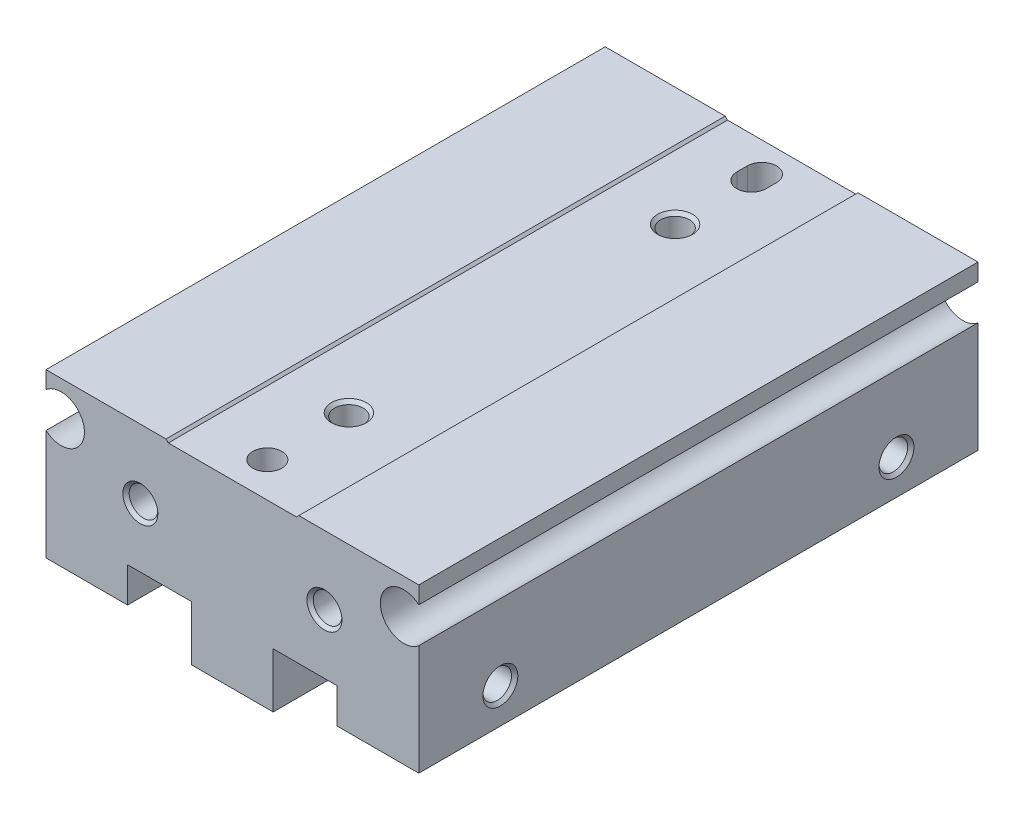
ISO-10303-21;
HEADER;
FILE_DESCRIPTION(('STEP AP214'),'2;1');
FILE_NAME('part.step','',(''),(''),'','','');
FILE_SCHEMA(('AUTOMOTIVE_DESIGN { 1 0 10303 214 1 1 1 1 }'));
ENDSEC;
DATA;
#1=APPLICATION_CONTEXT('core data for automotive mechanical design processes');
#2=APPLICATION_PROTOCOL_DEFINITION('international standard','automotive_design',2000,#1);
#3=PRODUCT_CONTEXT('',#1,'mechanical');
#4=PRODUCT('Part','Part','',(#3));
#5=PRODUCT_RELATED_PRODUCT_CATEGORY('part','',(#4));
#6=PRODUCT_DEFINITION_FORMATION('','',#4);
#7=PRODUCT_DEFINITION_CONTEXT('part definition',#1,'design');
#8=PRODUCT_DEFINITION('design','',#6,#7);
#9=PRODUCT_DEFINITION_SHAPE('','',#8);
#10=(LENGTH_UNIT() NAMED_UNIT(*) SI_UNIT(.MILLI.,.METRE.));
#11=(NAMED_UNIT(*) PLANE_ANGLE_UNIT() SI_UNIT($,.RADIAN.));
#12=(NAMED_UNIT(*) SI_UNIT($,.STERADIAN.) SOLID_ANGLE_UNIT());
#13=UNCERTAINTY_MEASURE_WITH_UNIT(LENGTH_MEASURE(1.E-05),#10,'distance_accuracy_value','');
#14=(GEOMETRIC_REPRESENTATION_CONTEXT(3) GLOBAL_UNCERTAINTY_ASSIGNED_CONTEXT((#13)) GLOBAL_UNIT_ASSIGNED_CONTEXT((#10,
#11,#12)) REPRESENTATION_CONTEXT('',''));
#15=CARTESIAN_POINT('',(0.,0.,0.));
#16=DIRECTION('',(0.,0.,1.));
#17=DIRECTION('',(1.,0.,0.));
#18=AXIS2_PLACEMENT_3D('',#15,#16,#17);
#19=CARTESIAN_POINT('',(3.5,-11.,-6.2));
#20=DIRECTION('',(0.,-1.,0.));
#21=DIRECTION('',(1.,0.,0.));
#22=AXIS2_PLACEMENT_3D('',#19,#20,#21);
#23=PLANE('',#22);
#24=DIRECTION('',(1.,0.,0.));
#25=VECTOR('',#24,1.);
#26=CARTESIAN_POINT('',(3.5,-11.,-6.2));
#27=LINE('',#26,#25);
#28=CARTESIAN_POINT('',(3.5,-11.,-6.2));
#29=VERTEX_POINT('',#28);
#30=CARTESIAN_POINT('',(9.,-11.,-6.2));
#31=VERTEX_POINT('',#30);
#32=EDGE_CURVE('E227',#29,#31,#27,.T.);
#33=ORIENTED_EDGE('',*,*,#32,.T.);
#34=DIRECTION('',(0.,0.,1.));
#35=VECTOR('',#34,1.);
#36=CARTESIAN_POINT('',(9.,-11.,-6.2));
#37=LINE('',#36,#35);
#38=CARTESIAN_POINT('',(9.,-11.,24.));
#39=VERTEX_POINT('',#38);
#40=EDGE_CURVE('E240',#39,#31,#37,.F.);
#41=ORIENTED_EDGE('',*,*,#40,.F.);
#42=DIRECTION('',(-1.,0.,0.));
#43=VECTOR('',#42,1.);
#44=CARTESIAN_POINT('',(9.,-11.,24.));
#45=LINE('',#44,#43);
#46=CARTESIAN_POINT('',(3.5,-11.,24.));
#47=VERTEX_POINT('',#46);
#48=EDGE_CURVE('E248',#47,#39,#45,.F.);
#49=ORIENTED_EDGE('',*,*,#48,.F.);
#50=DIRECTION('',(0.,0.,-1.));
#51=VECTOR('',#50,1.);
#52=CARTESIAN_POINT('',(3.5,-11.,24.));
#53=LINE('',#52,#51);
#54=EDGE_CURVE('E242',#47,#29,#53,.T.);
#55=ORIENTED_EDGE('',*,*,#54,.T.);
#56=EDGE_LOOP('',(#33,#41,#49,#55));
#57=FACE_BOUND('',#56,.T.);
#58=ADVANCED_FACE('F16',(#57),#23,.T.);
#59=CARTESIAN_POINT('',(3.5,-11.,-24.));
#60=DIRECTION('',(0.,-1.,0.));
#61=DIRECTION('',(1.,0.,0.));
#62=AXIS2_PLACEMENT_3D('',#59,#60,#61);
#63=PLANE('',#62);
#64=DIRECTION('',(-1.,0.,0.));
#65=VECTOR('',#64,1.);
#66=CARTESIAN_POINT('',(9.00000000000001,-11.,-15.2));
#67=LINE('',#66,#65);
#68=CARTESIAN_POINT('',(9.00000000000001,-11.,-15.2));
#69=VERTEX_POINT('',#68);
#70=CARTESIAN_POINT('',(3.5,-11.,-15.2));
#71=VERTEX_POINT('',#70);
#72=EDGE_CURVE('E259',#69,#71,#67,.T.);
#73=ORIENTED_EDGE('',*,*,#72,.T.);
#74=DIRECTION('',(0.,0.,-1.));
#75=VECTOR('',#74,1.);
#76=CARTESIAN_POINT('',(3.5,-11.,-15.2));
#77=LINE('',#76,#75);
#78=CARTESIAN_POINT('',(3.5,-11.,-24.));
#79=VERTEX_POINT('',#78);
#80=EDGE_CURVE('E264',#71,#79,#77,.T.);
#81=ORIENTED_EDGE('',*,*,#80,.T.);
#82=DIRECTION('',(1.,0.,0.));
#83=VECTOR('',#82,1.);
#84=CARTESIAN_POINT('',(3.5,-11.,-24.));
#85=LINE('',#84,#83);
#86=CARTESIAN_POINT('',(9.00000000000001,-11.,-24.));
#87=VERTEX_POINT('',#86);
#88=EDGE_CURVE('E269',#79,#87,#85,.T.);
#89=ORIENTED_EDGE('',*,*,#88,.T.);
#90=DIRECTION('',(0.,0.,1.));
#91=VECTOR('',#90,1.);
#92=CARTESIAN_POINT('',(9.00000000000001,-11.,-24.));
#93=LINE('',#92,#91);
#94=EDGE_CURVE('E274',#69,#87,#93,.F.);
#95=ORIENTED_EDGE('',*,*,#94,.F.);
#96=EDGE_LOOP('',(#73,#81,#89,#95));
#97=FACE_BOUND('',#96,.T.);
#98=ADVANCED_FACE('F844',(#97),#63,.T.);
#99=CARTESIAN_POINT('',(-9.,-11.,15.2));
#100=DIRECTION('',(0.,-1.,0.));
#101=DIRECTION('',(1.,0.,0.));
#102=AXIS2_PLACEMENT_3D('',#99,#100,#101);
#103=PLANE('',#102);
#104=DIRECTION('',(1.,0.,0.));
#105=VECTOR('',#104,1.);
#106=CARTESIAN_POINT('',(-9.,-11.,15.2));
#107=LINE('',#106,#105);
#108=CARTESIAN_POINT('',(-9.,-11.,15.2));
#109=VERTEX_POINT('',#108);
#110=CARTESIAN_POINT('',(-3.5,-11.,15.2));
#111=VERTEX_POINT('',#110);
#112=EDGE_CURVE('E279',#109,#111,#107,.T.);
#113=ORIENTED_EDGE('',*,*,#112,.T.);
#114=DIRECTION('',(0.,0.,1.));
#115=VECTOR('',#114,1.);
#116=CARTESIAN_POINT('',(-3.5,-11.,15.2));
#117=LINE('',#116,#115);
#118=CARTESIAN_POINT('',(-3.5,-11.,24.));
#119=VERTEX_POINT('',#118);
#120=EDGE_CURVE('E284',#119,#111,#117,.F.);
#121=ORIENTED_EDGE('',*,*,#120,.F.);
#122=DIRECTION('',(-1.,0.,0.));
#123=VECTOR('',#122,1.);
#124=CARTESIAN_POINT('',(-3.5,-11.,24.));
#125=LINE('',#124,#123);
#126=CARTESIAN_POINT('',(-9.,-11.,24.));
#127=VERTEX_POINT('',#126);
#128=EDGE_CURVE('E289',#127,#119,#125,.F.);
#129=ORIENTED_EDGE('',*,*,#128,.F.);
#130=DIRECTION('',(0.,0.,-1.));
#131=VECTOR('',#130,1.);
#132=CARTESIAN_POINT('',(-9.,-11.,24.));
#133=LINE('',#132,#131);
#134=EDGE_CURVE('E293',#127,#109,#133,.T.);
#135=ORIENTED_EDGE('',*,*,#134,.T.);
#136=EDGE_LOOP('',(#113,#121,#129,#135));
#137=FACE_BOUND('',#136,.T.);
#138=ADVANCED_FACE('F849',(#137),#103,.T.);
#139=CARTESIAN_POINT('',(-9.,-11.,-24.));
#140=DIRECTION('',(0.,-1.,0.));
#141=DIRECTION('',(1.,0.,0.));
#142=AXIS2_PLACEMENT_3D('',#139,#140,#141);
#143=PLANE('',#142);
#144=DIRECTION('',(-1.,0.,0.));
#145=VECTOR('',#144,1.);
#146=CARTESIAN_POINT('',(-3.5,-11.,6.2));
#147=LINE('',#146,#145);
#148=CARTESIAN_POINT('',(-3.5,-11.,6.2));
#149=VERTEX_POINT('',#148);
#150=CARTESIAN_POINT('',(-9.,-11.,6.2));
#151=VERTEX_POINT('',#150);
#152=EDGE_CURVE('E298',#149,#151,#147,.T.);
#153=ORIENTED_EDGE('',*,*,#152,.T.);
#154=DIRECTION('',(0.,0.,-1.));
#155=VECTOR('',#154,1.);
#156=CARTESIAN_POINT('',(-9.,-11.,6.2));
#157=LINE('',#156,#155);
#158=CARTESIAN_POINT('',(-9.,-11.,-24.));
#159=VERTEX_POINT('',#158);
#160=EDGE_CURVE('E303',#151,#159,#157,.T.);
#161=ORIENTED_EDGE('',*,*,#160,.T.);
#162=DIRECTION('',(1.,0.,0.));
#163=VECTOR('',#162,1.);
#164=CARTESIAN_POINT('',(-9.,-11.,-24.));
#165=LINE('',#164,#163);
#166=CARTESIAN_POINT('',(-3.5,-11.,-24.));
#167=VERTEX_POINT('',#166);
#168=EDGE_CURVE('E308',#159,#167,#165,.T.);
#169=ORIENTED_EDGE('',*,*,#168,.T.);
#170=DIRECTION('',(0.,0.,1.));
#171=VECTOR('',#170,1.);
#172=CARTESIAN_POINT('',(-3.5,-11.,-24.));
#173=LINE('',#172,#171);
#174=EDGE_CURVE('E313',#149,#167,#173,.F.);
#175=ORIENTED_EDGE('',*,*,#174,.F.);
#176=EDGE_LOOP('',(#153,#161,#169,#175));
#177=FACE_BOUND('',#176,.T.);
#178=ADVANCED_FACE('F855',(#177),#143,.T.);
#179=CARTESIAN_POINT('',(-16.,-1.48013158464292,24.));
#180=DIRECTION('',(-1.,0.,0.));
#181=DIRECTION('',(0.,1.,0.));
#182=AXIS2_PLACEMENT_3D('',#179,#180,#181);
#183=PLANE('',#182);
#184=DIRECTION('',(0.,-1.,0.));
#185=VECTOR('',#184,1.);
#186=CARTESIAN_POINT('',(-16.,0.,-24.));
#187=LINE('',#186,#185);
#188=CARTESIAN_POINT('',(-16.,0.,-24.));
#189=VERTEX_POINT('',#188);
#190=CARTESIAN_POINT('',(-16.,-1.48013158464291,-24.));
#191=VERTEX_POINT('',#190);
#192=EDGE_CURVE('E318',#189,#191,#187,.T.);
#193=ORIENTED_EDGE('',*,*,#192,.T.);
#194=DIRECTION('',(0.,0.,1.));
#195=VECTOR('',#194,1.);
#196=CARTESIAN_POINT('',(-16.,-1.48013158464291,-24.));
#197=LINE('',#196,#195);
#198=CARTESIAN_POINT('',(-16.,-1.48013158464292,24.));
#199=VERTEX_POINT('',#198);
#200=EDGE_CURVE('E323',#199,#191,#197,.F.);
#201=ORIENTED_EDGE('',*,*,#200,.F.);
#202=DIRECTION('',(0.,1.,0.));
#203=VECTOR('',#202,1.);
#204=CARTESIAN_POINT('',(-16.,-1.48013158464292,24.));
#205=LINE('',#204,#203);
#206=CARTESIAN_POINT('',(-16.,0.,24.));
#207=VERTEX_POINT('',#206);
#208=EDGE_CURVE('E328',#207,#199,#205,.F.);
#209=ORIENTED_EDGE('',*,*,#208,.F.);
#210=DIRECTION('',(0.,0.,-1.));
#211=VECTOR('',#210,1.);
#212=CARTESIAN_POINT('',(-16.,0.,24.));
#213=LINE('',#212,#211);
#214=EDGE_CURVE('E332',#207,#189,#213,.T.);
#215=ORIENTED_EDGE('',*,*,#214,.T.);
#216=EDGE_LOOP('',(#193,#201,#209,#215));
#217=FACE_BOUND('',#216,.T.);
#218=ADVANCED_FACE('F859',(#217),#183,.T.);
#219=CARTESIAN_POINT('',(-14.7,-3.,24.));
#220=DIRECTION('',(0.,0.,-1.));
#221=DIRECTION('',(-0.649999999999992,0.75993420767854,0.));
#222=AXIS2_PLACEMENT_3D('',#219,#220,#221);
#223=CYLINDRICAL_SURFACE('',#222,2.);
#224=ORIENTED_EDGE('',*,*,#200,.T.);
#225=CARTESIAN_POINT('',(-14.7,-3.,-24.));
#226=DIRECTION('',(0.,0.,-1.));
#227=DIRECTION('',(-0.649999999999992,0.75993420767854,0.));
#228=AXIS2_PLACEMENT_3D('',#225,#226,#227);
#229=CIRCLE('',#228,2.);
#230=CARTESIAN_POINT('',(-16.,-4.51986841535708,-24.));
#231=VERTEX_POINT('',#230);
#232=EDGE_CURVE('E337',#231,#191,#229,.F.);
#233=ORIENTED_EDGE('',*,*,#232,.F.);
#234=DIRECTION('',(0.,0.,1.));
#235=VECTOR('',#234,1.);
#236=CARTESIAN_POINT('',(-16.,-4.51986841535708,-24.));
#237=LINE('',#236,#235);
#238=CARTESIAN_POINT('',(-16.,-4.51986841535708,24.));
#239=VERTEX_POINT('',#238);
#240=EDGE_CURVE('E341',#239,#231,#237,.F.);
#241=ORIENTED_EDGE('',*,*,#240,.F.);
#242=CARTESIAN_POINT('',(-14.7,-3.,24.));
#243=DIRECTION('',(0.,0.,1.));
#244=DIRECTION('',(-0.649999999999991,-0.75993420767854,0.));
#245=AXIS2_PLACEMENT_3D('',#242,#243,#244);
#246=CIRCLE('',#245,2.);
#247=EDGE_CURVE('E346',#239,#199,#246,.T.);
#248=ORIENTED_EDGE('',*,*,#247,.T.);
#249=EDGE_LOOP('',(#224,#233,#241,#248));
#250=FACE_BOUND('',#249,.T.);
#251=ADVANCED_FACE('F863',(#250),#223,.F.);
#252=CARTESIAN_POINT('',(-16.,-14.,24.));
#253=DIRECTION('',(-1.,0.,0.));
#254=DIRECTION('',(0.,1.,0.));
#255=AXIS2_PLACEMENT_3D('',#252,#253,#254);
#256=PLANE('',#255);
#257=DIRECTION('',(0.,-1.,0.));
#258=VECTOR('',#257,1.);
#259=CARTESIAN_POINT('',(-16.,-4.51986841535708,-24.));
#260=LINE('',#259,#258);
#261=CARTESIAN_POINT('',(-16.,-14.,-24.));
#262=VERTEX_POINT('',#261);
#263=EDGE_CURVE('E351',#231,#262,#260,.T.);
#264=ORIENTED_EDGE('',*,*,#263,.T.);
#265=DIRECTION('',(0.,0.,1.));
#266=VECTOR('',#265,1.);
#267=CARTESIAN_POINT('',(-16.,-14.,-24.));
#268=LINE('',#267,#266);
#269=CARTESIAN_POINT('',(-16.,-14.,24.));
#270=VERTEX_POINT('',#269);
#271=EDGE_CURVE('E356',#270,#262,#268,.F.);
#272=ORIENTED_EDGE('',*,*,#271,.F.);
#273=DIRECTION('',(0.,1.,0.));
#274=VECTOR('',#273,1.);
#275=CARTESIAN_POINT('',(-16.,-14.,24.));
#276=LINE('',#275,#274);
#277=EDGE_CURVE('E361',#239,#270,#276,.F.);
#278=ORIENTED_EDGE('',*,*,#277,.F.);
#279=ORIENTED_EDGE('',*,*,#240,.T.);
#280=EDGE_LOOP('',(#264,#272,#278,#279));
#281=FACE_BOUND('',#280,.T.);
#282=CARTESIAN_POINT('',(-16.,-11.,-17.));
#283=DIRECTION('',(1.,0.,0.));
#284=DIRECTION('',(0.,0.,1.));
#285=AXIS2_PLACEMENT_3D('',#282,#283,#284);
#286=CIRCLE('',#285,1.5);
#287=CARTESIAN_POINT('',(-16.,-11.,-15.5));
#288=VERTEX_POINT('',#287);
#289=EDGE_CURVE('E365',#288,#288,#286,.F.);
#290=ORIENTED_EDGE('',*,*,#289,.F.);
#291=EDGE_LOOP('',(#290));
#292=FACE_BOUND('',#291,.T.);
#293=CARTESIAN_POINT('',(-16.,-11.,17.));
#294=DIRECTION('',(1.,0.,0.));
#295=DIRECTION('',(0.,0.,1.));
#296=AXIS2_PLACEMENT_3D('',#293,#294,#295);
#297=CIRCLE('',#296,1.5);
#298=CARTESIAN_POINT('',(-16.,-11.,18.5));
#299=VERTEX_POINT('',#298);
#300=EDGE_CURVE('E370',#299,#299,#297,.F.);
#301=ORIENTED_EDGE('',*,*,#300,.F.);
#302=EDGE_LOOP('',(#301));
#303=FACE_BOUND('',#302,.T.);
#304=ADVANCED_FACE('F867',(#281,#292,#303),#256,.T.);
#305=CARTESIAN_POINT('',(-16.,-14.,-24.));
#306=DIRECTION('',(0.,-1.,0.));
#307=DIRECTION('',(1.,0.,0.));
#308=AXIS2_PLACEMENT_3D('',#305,#306,#307);
#309=PLANE('',#308);
#310=DIRECTION('',(1.,0.,0.));
#311=VECTOR('',#310,1.);
#312=CARTESIAN_POINT('',(-16.,-14.,-24.));
#313=LINE('',#312,#311);
#314=CARTESIAN_POINT('',(-9.,-14.,-24.));
#315=VERTEX_POINT('',#314);
#316=EDGE_CURVE('E373',#262,#315,#313,.T.);
#317=ORIENTED_EDGE('',*,*,#316,.T.);
#318=DIRECTION('',(0.,0.,1.));
#319=VECTOR('',#318,1.);
#320=CARTESIAN_POINT('',(-9.,-14.,-24.));
#321=LINE('',#320,#319);
#322=CARTESIAN_POINT('',(-9.,-14.,24.));
#323=VERTEX_POINT('',#322);
#324=EDGE_CURVE('E376',#323,#315,#321,.F.);
#325=ORIENTED_EDGE('',*,*,#324,.F.);
#326=DIRECTION('',(-1.,0.,0.));
#327=VECTOR('',#326,1.);
#328=CARTESIAN_POINT('',(-9.,-14.,24.));
#329=LINE('',#328,#327);
#330=EDGE_CURVE('E381',#270,#323,#329,.F.);
#331=ORIENTED_EDGE('',*,*,#330,.F.);
#332=ORIENTED_EDGE('',*,*,#271,.T.);
#333=EDGE_LOOP('',(#317,#325,#331,#332));
#334=FACE_BOUND('',#333,.T.);
#335=CARTESIAN_POINT('',(-13.,-14.,13.));
#336=DIRECTION('',(0.,1.,0.));
#337=DIRECTION('',(0.,0.,-1.));
#338=AXIS2_PLACEMENT_3D('',#335,#336,#337);
#339=CIRCLE('',#338,1.5);
#340=CARTESIAN_POINT('',(-13.,-14.,11.5));
#341=VERTEX_POINT('',#340);
#342=EDGE_CURVE('E385',#341,#341,#339,.T.);
#343=ORIENTED_EDGE('',*,*,#342,.T.);
#344=EDGE_LOOP('',(#343));
#345=FACE_BOUND('',#344,.T.);
#346=CARTESIAN_POINT('',(-13.,-14.,-13.));
#347=DIRECTION('',(0.,1.,0.));
#348=DIRECTION('',(-1.42053859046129E-07,0.,-0.99999999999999));
#349=AXIS2_PLACEMENT_3D('',#346,#347,#348);
#350=CIRCLE('',#349,1.5);
#351=CARTESIAN_POINT('',(-13.0000002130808,-14.,-14.5));
#352=VERTEX_POINT('',#351);
#353=EDGE_CURVE('E390',#352,#352,#350,.T.);
#354=ORIENTED_EDGE('',*,*,#353,.T.);
#355=EDGE_LOOP('',(#354));
#356=FACE_BOUND('',#355,.T.);
#357=ADVANCED_FACE('F871',(#334,#345,#356),#309,.T.);
#358=CARTESIAN_POINT('',(-9.,-14.,-24.));
#359=DIRECTION('',(1.,0.,0.));
#360=DIRECTION('',(0.,1.,0.));
#361=AXIS2_PLACEMENT_3D('',#358,#359,#360);
#362=PLANE('',#361);
#363=DIRECTION('',(0.,1.,0.));
#364=VECTOR('',#363,1.);
#365=CARTESIAN_POINT('',(-9.,-14.,-24.));
#366=LINE('',#365,#364);
#367=EDGE_CURVE('E393',#315,#159,#366,.T.);
#368=ORIENTED_EDGE('',*,*,#367,.T.);
#369=ORIENTED_EDGE('',*,*,#160,.F.);
#370=DIRECTION('',(0.,1.,0.));
#371=VECTOR('',#370,1.);
#372=CARTESIAN_POINT('',(-9.,-11.,6.2));
#373=LINE('',#372,#371);
#374=CARTESIAN_POINT('',(-9.,-9.4,6.2));
#375=VERTEX_POINT('',#374);
#376=EDGE_CURVE('E396',#375,#151,#373,.F.);
#377=ORIENTED_EDGE('',*,*,#376,.F.);
#378=DIRECTION('',(0.,0.,1.));
#379=VECTOR('',#378,1.);
#380=CARTESIAN_POINT('',(-9.,-9.4,6.2));
#381=LINE('',#380,#379);
#382=CARTESIAN_POINT('',(-9.,-9.4,15.2));
#383=VERTEX_POINT('',#382);
#384=EDGE_CURVE('E400',#375,#383,#381,.T.);
#385=ORIENTED_EDGE('',*,*,#384,.T.);
#386=DIRECTION('',(0.,-1.,0.));
#387=VECTOR('',#386,1.);
#388=CARTESIAN_POINT('',(-9.,-9.4,15.2));
#389=LINE('',#388,#387);
#390=EDGE_CURVE('E405',#383,#109,#389,.T.);
#391=ORIENTED_EDGE('',*,*,#390,.T.);
#392=ORIENTED_EDGE('',*,*,#134,.F.);
#393=DIRECTION('',(0.,-1.,0.));
#394=VECTOR('',#393,1.);
#395=CARTESIAN_POINT('',(-9.,-11.,24.));
#396=LINE('',#395,#394);
#397=EDGE_CURVE('E410',#323,#127,#396,.F.);
#398=ORIENTED_EDGE('',*,*,#397,.F.);
#399=ORIENTED_EDGE('',*,*,#324,.T.);
#400=EDGE_LOOP('',(#368,#369,#377,#385,#391,#392,#398,#399));
#401=FACE_BOUND('',#400,.T.);
#402=ADVANCED_FACE('F875',(#401),#362,.T.);
#403=CARTESIAN_POINT('',(-3.5,-15.7,24.));
#404=DIRECTION('',(-1.,0.,0.));
#405=DIRECTION('',(0.,1.,0.));
#406=AXIS2_PLACEMENT_3D('',#403,#404,#405);
#407=PLANE('',#406);
#408=DIRECTION('',(0.,-1.,0.));
#409=VECTOR('',#408,1.);
#410=CARTESIAN_POINT('',(-3.5,-11.,-24.));
#411=LINE('',#410,#409);
#412=CARTESIAN_POINT('',(-3.5,-15.7,-24.));
#413=VERTEX_POINT('',#412);
#414=EDGE_CURVE('E414',#167,#413,#411,.T.);
#415=ORIENTED_EDGE('',*,*,#414,.T.);
#416=DIRECTION('',(0.,0.,1.));
#417=VECTOR('',#416,1.);
#418=CARTESIAN_POINT('',(-3.5,-15.7,-24.));
#419=LINE('',#418,#417);
#420=CARTESIAN_POINT('',(-3.5,-15.7,24.));
#421=VERTEX_POINT('',#420);
#422=EDGE_CURVE('E419',#421,#413,#419,.F.);
#423=ORIENTED_EDGE('',*,*,#422,.F.);
#424=DIRECTION('',(0.,1.,0.));
#425=VECTOR('',#424,1.);
#426=CARTESIAN_POINT('',(-3.5,-15.7,24.));
#427=LINE('',#426,#425);
#428=EDGE_CURVE('E424',#119,#421,#427,.F.);
#429=ORIENTED_EDGE('',*,*,#428,.F.);
#430=ORIENTED_EDGE('',*,*,#120,.T.);
#431=DIRECTION('',(0.,1.,0.));
#432=VECTOR('',#431,1.);
#433=CARTESIAN_POINT('',(-3.5,-11.,15.2));
#434=LINE('',#433,#432);
#435=CARTESIAN_POINT('',(-3.5,-9.4,15.2));
#436=VERTEX_POINT('',#435);
#437=EDGE_CURVE('E428',#436,#111,#434,.F.);
#438=ORIENTED_EDGE('',*,*,#437,.F.);
#439=DIRECTION('',(0.,0.,-1.));
#440=VECTOR('',#439,1.);
#441=CARTESIAN_POINT('',(-3.5,-9.4,15.2));
#442=LINE('',#441,#440);
#443=CARTESIAN_POINT('',(-3.5,-9.4,6.2));
#444=VERTEX_POINT('',#443);
#445=EDGE_CURVE('E432',#436,#444,#442,.T.);
#446=ORIENTED_EDGE('',*,*,#445,.T.);
#447=DIRECTION('',(0.,-1.,0.));
#448=VECTOR('',#447,1.);
#449=CARTESIAN_POINT('',(-3.5,-9.4,6.2));
#450=LINE('',#449,#448);
#451=EDGE_CURVE('E437',#444,#149,#450,.T.);
#452=ORIENTED_EDGE('',*,*,#451,.T.);
#453=ORIENTED_EDGE('',*,*,#174,.T.);
#454=EDGE_LOOP('',(#415,#423,#429,#430,#438,#446,#452,#453));
#455=FACE_BOUND('',#454,.T.);
#456=ADVANCED_FACE('F879',(#455),#407,.T.);
#457=CARTESIAN_POINT('',(-3.5,-15.7,-24.));
#458=DIRECTION('',(0.,-1.,0.));
#459=DIRECTION('',(1.,0.,0.));
#460=AXIS2_PLACEMENT_3D('',#457,#458,#459);
#461=PLANE('',#460);
#462=DIRECTION('',(1.,0.,0.));
#463=VECTOR('',#462,1.);
#464=CARTESIAN_POINT('',(-3.5,-15.7,-24.));
#465=LINE('',#464,#463);
#466=CARTESIAN_POINT('',(3.5,-15.7,-24.));
#467=VERTEX_POINT('',#466);
#468=EDGE_CURVE('E442',#413,#467,#465,.T.);
#469=ORIENTED_EDGE('',*,*,#468,.T.);
#470=DIRECTION('',(0.,0.,1.));
#471=VECTOR('',#470,1.);
#472=CARTESIAN_POINT('',(3.5,-15.7,-24.));
#473=LINE('',#472,#471);
#474=CARTESIAN_POINT('',(3.5,-15.7,24.));
#475=VERTEX_POINT('',#474);
#476=EDGE_CURVE('E447',#475,#467,#473,.F.);
#477=ORIENTED_EDGE('',*,*,#476,.F.);
#478=DIRECTION('',(-1.,0.,0.));
#479=VECTOR('',#478,1.);
#480=CARTESIAN_POINT('',(3.5,-15.7,24.));
#481=LINE('',#480,#479);
#482=EDGE_CURVE('E452',#421,#475,#481,.F.);
#483=ORIENTED_EDGE('',*,*,#482,.F.);
#484=ORIENTED_EDGE('',*,*,#422,.T.);
#485=EDGE_LOOP('',(#469,#477,#483,#484));
#486=FACE_BOUND('',#485,.T.);
#487=CARTESIAN_POINT('',(0.,-15.7,-14.));
#488=DIRECTION('',(0.,1.,0.));
#489=DIRECTION('',(0.,0.,-1.));
#490=AXIS2_PLACEMENT_3D('',#487,#488,#489);
#491=CIRCLE('',#490,2.25);
#492=CARTESIAN_POINT('',(0.,-15.7,-16.25));
#493=VERTEX_POINT('',#492);
#494=EDGE_CURVE('E456',#493,#493,#491,.F.);
#495=ORIENTED_EDGE('',*,*,#494,.F.);
#496=EDGE_LOOP('',(#495));
#497=FACE_BOUND('',#496,.T.);
#498=CARTESIAN_POINT('',(0.,-15.7,14.));
#499=DIRECTION('',(0.,1.,0.));
#500=DIRECTION('',(0.,0.,-1.));
#501=AXIS2_PLACEMENT_3D('',#498,#499,#500);
#502=CIRCLE('',#501,2.25);
#503=CARTESIAN_POINT('',(0.,-15.7,11.75));
#504=VERTEX_POINT('',#503);
#505=EDGE_CURVE('E461',#504,#504,#502,.F.);
#506=ORIENTED_EDGE('',*,*,#505,.F.);
#507=EDGE_LOOP('',(#506));
#508=FACE_BOUND('',#507,.T.);
#509=ADVANCED_FACE('F883',(#486,#497,#508),#461,.T.);
#510=CARTESIAN_POINT('',(3.5,-15.7,-24.));
#511=DIRECTION('',(1.,0.,0.));
#512=DIRECTION('',(0.,1.,0.));
#513=AXIS2_PLACEMENT_3D('',#510,#511,#512);
#514=PLANE('',#513);
#515=DIRECTION('',(0.,1.,0.));
#516=VECTOR('',#515,1.);
#517=CARTESIAN_POINT('',(3.5,-15.7,-24.));
#518=LINE('',#517,#516);
#519=EDGE_CURVE('E464',#467,#79,#518,.T.);
#520=ORIENTED_EDGE('',*,*,#519,.T.);
#521=ORIENTED_EDGE('',*,*,#80,.F.);
#522=DIRECTION('',(0.,1.,0.));
#523=VECTOR('',#522,1.);
#524=CARTESIAN_POINT('',(3.5,-11.,-15.2));
#525=LINE('',#524,#523);
#526=CARTESIAN_POINT('',(3.5,-9.4,-15.2));
#527=VERTEX_POINT('',#526);
#528=EDGE_CURVE('E467',#527,#71,#525,.F.);
#529=ORIENTED_EDGE('',*,*,#528,.F.);
#530=DIRECTION('',(0.,0.,1.));
#531=VECTOR('',#530,1.);
#532=CARTESIAN_POINT('',(3.5,-9.4,-15.2));
#533=LINE('',#532,#531);
#534=CARTESIAN_POINT('',(3.5,-9.4,-6.2));
#535=VERTEX_POINT('',#534);
#536=EDGE_CURVE('E471',#527,#535,#533,.T.);
#537=ORIENTED_EDGE('',*,*,#536,.T.);
#538=DIRECTION('',(0.,-1.,0.));
#539=VECTOR('',#538,1.);
#540=CARTESIAN_POINT('',(3.5,-9.4,-6.2));
#541=LINE('',#540,#539);
#542=EDGE_CURVE('E476',#535,#29,#541,.T.);
#543=ORIENTED_EDGE('',*,*,#542,.T.);
#544=ORIENTED_EDGE('',*,*,#54,.F.);
#545=DIRECTION('',(0.,-1.,0.));
#546=VECTOR('',#545,1.);
#547=CARTESIAN_POINT('',(3.5,-11.,24.));
#548=LINE('',#547,#546);
#549=EDGE_CURVE('E480',#475,#47,#548,.F.);
#550=ORIENTED_EDGE('',*,*,#549,.F.);
#551=ORIENTED_EDGE('',*,*,#476,.T.);
#552=EDGE_LOOP('',(#520,#521,#529,#537,#543,#544,#550,#551));
#553=FACE_BOUND('',#552,.T.);
#554=ADVANCED_FACE('F887',(#553),#514,.T.);
#555=CARTESIAN_POINT('',(9.,-14.,24.));
#556=DIRECTION('',(-1.,0.,0.));
#557=DIRECTION('',(0.,1.,0.));
#558=AXIS2_PLACEMENT_3D('',#555,#556,#557);
#559=PLANE('',#558);
#560=DIRECTION('',(0.,-1.,0.));
#561=VECTOR('',#560,1.);
#562=CARTESIAN_POINT('',(9.,-11.,-24.));
#563=LINE('',#562,#561);
#564=CARTESIAN_POINT('',(9.,-14.,-24.));
#565=VERTEX_POINT('',#564);
#566=EDGE_CURVE('E484',#87,#565,#563,.T.);
#567=ORIENTED_EDGE('',*,*,#566,.T.);
#568=DIRECTION('',(0.,0.,1.));
#569=VECTOR('',#568,1.);
#570=CARTESIAN_POINT('',(9.,-14.,-24.));
#571=LINE('',#570,#569);
#572=CARTESIAN_POINT('',(9.,-14.,24.));
#573=VERTEX_POINT('',#572);
#574=EDGE_CURVE('E488',#573,#565,#571,.F.);
#575=ORIENTED_EDGE('',*,*,#574,.F.);
#576=DIRECTION('',(0.,1.,0.));
#577=VECTOR('',#576,1.);
#578=CARTESIAN_POINT('',(9.,-14.,24.));
#579=LINE('',#578,#577);
#580=EDGE_CURVE('E234',#39,#573,#579,.F.);
#581=ORIENTED_EDGE('',*,*,#580,.F.);
#582=ORIENTED_EDGE('',*,*,#40,.T.);
#583=DIRECTION('',(0.,1.,0.));
#584=VECTOR('',#583,1.);
#585=CARTESIAN_POINT('',(9.,-11.,-6.2));
#586=LINE('',#585,#584);
#587=CARTESIAN_POINT('',(9.,-9.4,-6.2));
#588=VERTEX_POINT('',#587);
#589=EDGE_CURVE('E223',#588,#31,#586,.F.);
#590=ORIENTED_EDGE('',*,*,#589,.F.);
#591=DIRECTION('',(0.,0.,-1.));
#592=VECTOR('',#591,1.);
#593=CARTESIAN_POINT('',(9.,-9.4,-6.2));
#594=LINE('',#593,#592);
#595=CARTESIAN_POINT('',(9.,-9.4,-15.2));
#596=VERTEX_POINT('',#595);
#597=EDGE_CURVE('E233',#588,#596,#594,.T.);
#598=ORIENTED_EDGE('',*,*,#597,.T.);
#599=DIRECTION('',(0.,-1.,0.));
#600=VECTOR('',#599,1.);
#601=CARTESIAN_POINT('',(9.,-9.4,-15.2));
#602=LINE('',#601,#600);
#603=EDGE_CURVE('E501',#596,#69,#602,.T.);
#604=ORIENTED_EDGE('',*,*,#603,.T.);
#605=ORIENTED_EDGE('',*,*,#94,.T.);
#606=EDGE_LOOP('',(#567,#575,#581,#582,#590,#598,#604,#605));
#607=FACE_BOUND('',#606,.T.);
#608=ADVANCED_FACE('F246',(#607),#559,.T.);
#609=CARTESIAN_POINT('',(9.,-14.,-24.));
#610=DIRECTION('',(0.,-1.,0.));
#611=DIRECTION('',(1.,0.,0.));
#612=AXIS2_PLACEMENT_3D('',#609,#610,#611);
#613=PLANE('',#612);
#614=DIRECTION('',(1.,0.,0.));
#615=VECTOR('',#614,1.);
#616=CARTESIAN_POINT('',(9.,-14.,-24.));
#617=LINE('',#616,#615);
#618=CARTESIAN_POINT('',(16.,-14.,-24.));
#619=VERTEX_POINT('',#618);
#620=EDGE_CURVE('E506',#565,#619,#617,.T.);
#621=ORIENTED_EDGE('',*,*,#620,.T.);
#622=DIRECTION('',(0.,0.,1.));
#623=VECTOR('',#622,1.);
#624=CARTESIAN_POINT('',(16.,-14.,-24.));
#625=LINE('',#624,#623);
#626=CARTESIAN_POINT('',(16.,-14.,24.));
#627=VERTEX_POINT('',#626);
#628=EDGE_CURVE('E511',#627,#619,#625,.F.);
#629=ORIENTED_EDGE('',*,*,#628,.F.);
#630=DIRECTION('',(-1.,0.,0.));
#631=VECTOR('',#630,1.);
#632=CARTESIAN_POINT('',(16.,-14.,24.));
#633=LINE('',#632,#631);
#634=EDGE_CURVE('E516',#573,#627,#633,.F.);
#635=ORIENTED_EDGE('',*,*,#634,.F.);
#636=ORIENTED_EDGE('',*,*,#574,.T.);
#637=EDGE_LOOP('',(#621,#629,#635,#636));
#638=FACE_BOUND('',#637,.T.);
#639=CARTESIAN_POINT('',(13.,-14.,-13.));
#640=DIRECTION('',(0.,1.,0.));
#641=DIRECTION('',(-1.42053988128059E-07,0.,-0.99999999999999));
#642=AXIS2_PLACEMENT_3D('',#639,#640,#641);
#643=CIRCLE('',#642,1.5);
#644=CARTESIAN_POINT('',(12.999999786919,-14.,-14.5));
#645=VERTEX_POINT('',#644);
#646=EDGE_CURVE('E520',#645,#645,#643,.T.);
#647=ORIENTED_EDGE('',*,*,#646,.T.);
#648=EDGE_LOOP('',(#647));
#649=FACE_BOUND('',#648,.T.);
#650=CARTESIAN_POINT('',(13.,-14.,13.));
#651=DIRECTION('',(0.,1.,0.));
#652=DIRECTION('',(0.,0.,-1.));
#653=AXIS2_PLACEMENT_3D('',#650,#651,#652);
#654=CIRCLE('',#653,1.5);
#655=CARTESIAN_POINT('',(13.,-14.,11.5));
#656=VERTEX_POINT('',#655);
#657=EDGE_CURVE('E525',#656,#656,#654,.T.);
#658=ORIENTED_EDGE('',*,*,#657,.T.);
#659=EDGE_LOOP('',(#658));
#660=FACE_BOUND('',#659,.T.);
#661=ADVANCED_FACE('F894',(#638,#649,#660),#613,.T.);
#662=CARTESIAN_POINT('',(16.,-14.,-24.));
#663=DIRECTION('',(1.,0.,0.));
#664=DIRECTION('',(0.,1.,0.));
#665=AXIS2_PLACEMENT_3D('',#662,#663,#664);
#666=PLANE('',#665);
#667=DIRECTION('',(0.,1.,0.));
#668=VECTOR('',#667,1.);
#669=CARTESIAN_POINT('',(16.,-14.,-24.));
#670=LINE('',#669,#668);
#671=CARTESIAN_POINT('',(16.,-4.5198684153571,-24.));
#672=VERTEX_POINT('',#671);
#673=EDGE_CURVE('E528',#619,#672,#670,.T.);
#674=ORIENTED_EDGE('',*,*,#673,.T.);
#675=DIRECTION('',(0.,0.,1.));
#676=VECTOR('',#675,1.);
#677=CARTESIAN_POINT('',(16.,-4.5198684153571,-24.));
#678=LINE('',#677,#676);
#679=CARTESIAN_POINT('',(16.,-4.5198684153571,24.));
#680=VERTEX_POINT('',#679);
#681=EDGE_CURVE('E531',#680,#672,#678,.F.);
#682=ORIENTED_EDGE('',*,*,#681,.F.);
#683=DIRECTION('',(0.,-1.,0.));
#684=VECTOR('',#683,1.);
#685=CARTESIAN_POINT('',(16.,-4.5198684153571,24.));
#686=LINE('',#685,#684);
#687=EDGE_CURVE('E536',#627,#680,#686,.F.);
#688=ORIENTED_EDGE('',*,*,#687,.F.);
#689=ORIENTED_EDGE('',*,*,#628,.T.);
#690=EDGE_LOOP('',(#674,#682,#688,#689));
#691=FACE_BOUND('',#690,.T.);
#692=CARTESIAN_POINT('',(16.,-11.,-17.));
#693=DIRECTION('',(-1.,0.,0.));
#694=DIRECTION('',(0.,-1.42053989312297E-07,-0.99999999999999));
#695=AXIS2_PLACEMENT_3D('',#692,#693,#694);
#696=CIRCLE('',#695,1.5);
#697=CARTESIAN_POINT('',(16.,-11.000000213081,-18.5));
#698=VERTEX_POINT('',#697);
#699=EDGE_CURVE('E540',#698,#698,#696,.T.);
#700=ORIENTED_EDGE('',*,*,#699,.T.);
#701=EDGE_LOOP('',(#700));
#702=FACE_BOUND('',#701,.T.);
#703=CARTESIAN_POINT('',(16.,-11.,17.));
#704=DIRECTION('',(-1.,0.,0.));
#705=DIRECTION('',(0.,0.,-1.));
#706=AXIS2_PLACEMENT_3D('',#703,#704,#705);
#707=CIRCLE('',#706,1.5);
#708=CARTESIAN_POINT('',(16.,-11.,15.5));
#709=VERTEX_POINT('',#708);
#710=EDGE_CURVE('E545',#709,#709,#707,.T.);
#711=ORIENTED_EDGE('',*,*,#710,.T.);
#712=EDGE_LOOP('',(#711));
#713=FACE_BOUND('',#712,.T.);
#714=ADVANCED_FACE('F897',(#691,#702,#713),#666,.T.);
#715=CARTESIAN_POINT('',(14.7,-3.,24.));
#716=DIRECTION('',(0.,0.,-1.));
#717=DIRECTION('',(0.649999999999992,-0.75993420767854,0.));
#718=AXIS2_PLACEMENT_3D('',#715,#716,#717);
#719=CYLINDRICAL_SURFACE('',#718,2.);
#720=ORIENTED_EDGE('',*,*,#681,.T.);
#721=CARTESIAN_POINT('',(14.7,-3.,-24.));
#722=DIRECTION('',(0.,0.,-1.));
#723=DIRECTION('',(0.649999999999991,-0.75993420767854,0.));
#724=AXIS2_PLACEMENT_3D('',#721,#722,#723);
#725=CIRCLE('',#724,2.);
#726=CARTESIAN_POINT('',(16.,-1.48013158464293,-24.));
#727=VERTEX_POINT('',#726);
#728=EDGE_CURVE('E548',#727,#672,#725,.F.);
#729=ORIENTED_EDGE('',*,*,#728,.F.);
#730=DIRECTION('',(0.,0.,1.));
#731=VECTOR('',#730,1.);
#732=CARTESIAN_POINT('',(16.,-1.48013158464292,-24.));
#733=LINE('',#732,#731);
#734=CARTESIAN_POINT('',(16.,-1.48013158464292,24.));
#735=VERTEX_POINT('',#734);
#736=EDGE_CURVE('E550',#735,#727,#733,.F.);
#737=ORIENTED_EDGE('',*,*,#736,.F.);
#738=CARTESIAN_POINT('',(14.7,-3.,24.));
#739=DIRECTION('',(0.,0.,1.));
#740=DIRECTION('',(0.649999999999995,0.759934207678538,0.));
#741=AXIS2_PLACEMENT_3D('',#738,#739,#740);
#742=CIRCLE('',#741,2.);
#743=EDGE_CURVE('E555',#735,#680,#742,.T.);
#744=ORIENTED_EDGE('',*,*,#743,.T.);
#745=EDGE_LOOP('',(#720,#729,#737,#744));
#746=FACE_BOUND('',#745,.T.);
#747=ADVANCED_FACE('F901',(#746),#719,.F.);
#748=CARTESIAN_POINT('',(16.,-1.48013158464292,-24.));
#749=DIRECTION('',(1.,0.,0.));
#750=DIRECTION('',(0.,1.,0.));
#751=AXIS2_PLACEMENT_3D('',#748,#749,#750);
#752=PLANE('',#751);
#753=DIRECTION('',(0.,1.,0.));
#754=VECTOR('',#753,1.);
#755=CARTESIAN_POINT('',(16.,-1.48013158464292,-24.));
#756=LINE('',#755,#754);
#757=CARTESIAN_POINT('',(16.,0.,-24.));
#758=VERTEX_POINT('',#757);
#759=EDGE_CURVE('E560',#727,#758,#756,.T.);
#760=ORIENTED_EDGE('',*,*,#759,.T.);
#761=DIRECTION('',(0.,0.,1.));
#762=VECTOR('',#761,1.);
#763=CARTESIAN_POINT('',(16.,0.,-24.));
#764=LINE('',#763,#762);
#765=CARTESIAN_POINT('',(16.,0.,24.));
#766=VERTEX_POINT('',#765);
#767=EDGE_CURVE('E565',#766,#758,#764,.F.);
#768=ORIENTED_EDGE('',*,*,#767,.F.);
#769=DIRECTION('',(0.,-1.,0.));
#770=VECTOR('',#769,1.);
#771=CARTESIAN_POINT('',(16.,0.,24.));
#772=LINE('',#771,#770);
#773=EDGE_CURVE('E570',#735,#766,#772,.F.);
#774=ORIENTED_EDGE('',*,*,#773,.F.);
#775=ORIENTED_EDGE('',*,*,#736,.T.);
#776=EDGE_LOOP('',(#760,#768,#774,#775));
#777=FACE_BOUND('',#776,.T.);
#778=ADVANCED_FACE('F905',(#777),#752,.T.);
#779=CARTESIAN_POINT('',(5.7,0.,24.));
#780=DIRECTION('',(0.,1.,0.));
#781=DIRECTION('',(1.,0.,0.));
#782=AXIS2_PLACEMENT_3D('',#779,#780,#781);
#783=PLANE('',#782);
#784=DIRECTION('',(-1.,0.,0.));
#785=VECTOR('',#784,1.);
#786=CARTESIAN_POINT('',(16.,0.,-24.));
#787=LINE('',#786,#785);
#788=CARTESIAN_POINT('',(5.7,0.,-24.));
#789=VERTEX_POINT('',#788);
#790=EDGE_CURVE('E574',#758,#789,#787,.T.);
#791=ORIENTED_EDGE('',*,*,#790,.T.);
#792=DIRECTION('',(0.,0.,1.));
#793=VECTOR('',#792,1.);
#794=CARTESIAN_POINT('',(5.7,0.,-24.));
#795=LINE('',#794,#793);
#796=CARTESIAN_POINT('',(5.7,0.,24.));
#797=VERTEX_POINT('',#796);
#798=EDGE_CURVE('E579',#797,#789,#795,.F.);
#799=ORIENTED_EDGE('',*,*,#798,.F.);
#800=DIRECTION('',(1.,0.,0.));
#801=VECTOR('',#800,1.);
#802=CARTESIAN_POINT('',(5.7,0.,24.));
#803=LINE('',#802,#801);
#804=EDGE_CURVE('E584',#766,#797,#803,.F.);
#805=ORIENTED_EDGE('',*,*,#804,.F.);
#806=ORIENTED_EDGE('',*,*,#767,.T.);
#807=EDGE_LOOP('',(#791,#799,#805,#806));
#808=FACE_BOUND('',#807,.T.);
#809=ADVANCED_FACE('F909',(#808),#783,.T.);
#810=CARTESIAN_POINT('',(5.5,-0.200000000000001,-24.));
#811=DIRECTION('',(-0.707106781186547,0.707106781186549,0.));
#812=DIRECTION('',(0.,0.,1.));
#813=AXIS2_PLACEMENT_3D('',#810,#811,#812);
#814=PLANE('',#813);
#815=DIRECTION('',(-0.707106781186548,-0.707106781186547,0.));
#816=VECTOR('',#815,1.);
#817=CARTESIAN_POINT('',(5.7,0.,-24.));
#818=LINE('',#817,#816);
#819=CARTESIAN_POINT('',(5.5,-0.200000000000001,-24.));
#820=VERTEX_POINT('',#819);
#821=EDGE_CURVE('E588',#789,#820,#818,.T.);
#822=ORIENTED_EDGE('',*,*,#821,.T.);
#823=DIRECTION('',(0.,0.,1.));
#824=VECTOR('',#823,1.);
#825=CARTESIAN_POINT('',(5.5,-0.200000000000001,-24.));
#826=LINE('',#825,#824);
#827=CARTESIAN_POINT('',(5.5,-0.2,24.));
#828=VERTEX_POINT('',#827);
#829=EDGE_CURVE('E593',#828,#820,#826,.F.);
#830=ORIENTED_EDGE('',*,*,#829,.F.);
#831=DIRECTION('',(0.707106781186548,0.707106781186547,0.));
#832=VECTOR('',#831,1.);
#833=CARTESIAN_POINT('',(5.5,-0.2,24.));
#834=LINE('',#833,#832);
#835=EDGE_CURVE('E598',#797,#828,#834,.F.);
#836=ORIENTED_EDGE('',*,*,#835,.F.);
#837=ORIENTED_EDGE('',*,*,#798,.T.);
#838=EDGE_LOOP('',(#822,#830,#836,#837));
#839=FACE_BOUND('',#838,.T.);
#840=ADVANCED_FACE('F913',(#839),#814,.T.);
#841=CARTESIAN_POINT('',(-5.5,-0.2,24.));
#842=DIRECTION('',(0.,1.,0.));
#843=DIRECTION('',(1.,0.,0.));
#844=AXIS2_PLACEMENT_3D('',#841,#842,#843);
#845=PLANE('',#844);
#846=DIRECTION('',(-1.,0.,0.));
#847=VECTOR('',#846,1.);
#848=CARTESIAN_POINT('',(5.5,-0.2,-24.));
#849=LINE('',#848,#847);
#850=CARTESIAN_POINT('',(-5.5,-0.2,-24.));
#851=VERTEX_POINT('',#850);
#852=EDGE_CURVE('E602',#820,#851,#849,.T.);
#853=ORIENTED_EDGE('',*,*,#852,.T.);
#854=DIRECTION('',(0.,0.,1.));
#855=VECTOR('',#854,1.);
#856=CARTESIAN_POINT('',(-5.5,-0.2,-24.));
#857=LINE('',#856,#855);
#858=CARTESIAN_POINT('',(-5.5,-0.2,24.));
#859=VERTEX_POINT('',#858);
#860=EDGE_CURVE('E607',#859,#851,#857,.F.);
#861=ORIENTED_EDGE('',*,*,#860,.F.);
#862=DIRECTION('',(1.,0.,0.));
#863=VECTOR('',#862,1.);
#864=CARTESIAN_POINT('',(-5.5,-0.2,24.));
#865=LINE('',#864,#863);
#866=EDGE_CURVE('E612',#828,#859,#865,.F.);
#867=ORIENTED_EDGE('',*,*,#866,.F.);
#868=ORIENTED_EDGE('',*,*,#829,.T.);
#869=EDGE_LOOP('',(#853,#861,#867,#868));
#870=FACE_BOUND('',#869,.T.);
#871=CARTESIAN_POINT('',(0.,-0.2,-20.55));
#872=DIRECTION('',(0.,-1.,0.));
#873=DIRECTION('',(1.,0.,0.));
#874=AXIS2_PLACEMENT_3D('',#871,#872,#873);
#875=CIRCLE('',#874,1.25);
#876=CARTESIAN_POINT('',(-1.25,-0.2,-20.55));
#877=VERTEX_POINT('',#876);
#878=CARTESIAN_POINT('',(1.25,-0.2,-20.55));
#879=VERTEX_POINT('',#878);
#880=EDGE_CURVE('E616',#877,#879,#875,.F.);
#881=ORIENTED_EDGE('',*,*,#880,.F.);
#882=DIRECTION('',(0.,0.,-1.));
#883=VECTOR('',#882,1.);
#884=CARTESIAN_POINT('',(-1.25,-0.2,-20.55));
#885=LINE('',#884,#883);
#886=CARTESIAN_POINT('',(-1.25,-0.2,-21.45));
#887=VERTEX_POINT('',#886);
#888=EDGE_CURVE('E621',#887,#877,#885,.F.);
#889=ORIENTED_EDGE('',*,*,#888,.F.);
#890=CARTESIAN_POINT('',(0.,-0.2,-21.45));
#891=DIRECTION('',(0.,-1.,0.));
#892=DIRECTION('',(-1.,0.,0.));
#893=AXIS2_PLACEMENT_3D('',#890,#891,#892);
#894=CIRCLE('',#893,1.25);
#895=CARTESIAN_POINT('',(1.25,-0.2,-21.45));
#896=VERTEX_POINT('',#895);
#897=EDGE_CURVE('E626',#896,#887,#894,.F.);
#898=ORIENTED_EDGE('',*,*,#897,.F.);
#899=DIRECTION('',(0.,0.,1.));
#900=VECTOR('',#899,1.);
#901=CARTESIAN_POINT('',(1.25,-0.2,-21.45));
#902=LINE('',#901,#900);
#903=EDGE_CURVE('E630',#879,#896,#902,.F.);
#904=ORIENTED_EDGE('',*,*,#903,.F.);
#905=EDGE_LOOP('',(#881,#889,#898,#904));
#906=FACE_BOUND('',#905,.T.);
#907=CARTESIAN_POINT('',(0.,-0.2,-14.));
#908=DIRECTION('',(0.,-1.,0.));
#909=DIRECTION('',(-1.42053989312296E-07,0.,0.99999999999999));
#910=AXIS2_PLACEMENT_3D('',#907,#908,#909);
#911=CIRCLE('',#910,1.5);
#912=CARTESIAN_POINT('',(-2.13080983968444E-07,-0.2,-12.5));
#913=VERTEX_POINT('',#912);
#914=EDGE_CURVE('E635',#913,#913,#911,.T.);
#915=ORIENTED_EDGE('',*,*,#914,.T.);
#916=EDGE_LOOP('',(#915));
#917=FACE_BOUND('',#916,.T.);
#918=CARTESIAN_POINT('',(0.,-0.2,14.));
#919=DIRECTION('',(0.,-1.,0.));
#920=DIRECTION('',(0.,0.,1.));
#921=AXIS2_PLACEMENT_3D('',#918,#919,#920);
#922=CIRCLE('',#921,1.5);
#923=CARTESIAN_POINT('',(0.,-0.2,15.5));
#924=VERTEX_POINT('',#923);
#925=EDGE_CURVE('E640',#924,#924,#922,.T.);
#926=ORIENTED_EDGE('',*,*,#925,.T.);
#927=EDGE_LOOP('',(#926));
#928=FACE_BOUND('',#927,.T.);
#929=CARTESIAN_POINT('',(0.,-0.2,21.));
#930=DIRECTION('',(0.,-1.,0.));
#931=DIRECTION('',(0.,0.,1.));
#932=AXIS2_PLACEMENT_3D('',#929,#930,#931);
#933=CIRCLE('',#932,1.25);
#934=CARTESIAN_POINT('',(0.,-0.2,22.25));
#935=VERTEX_POINT('',#934);
#936=EDGE_CURVE('E643',#935,#935,#933,.F.);
#937=ORIENTED_EDGE('',*,*,#936,.F.);
#938=EDGE_LOOP('',(#937));
#939=FACE_BOUND('',#938,.T.);
#940=ADVANCED_FACE('F917',(#870,#906,#917,#928,#939),#845,.T.);
#941=CARTESIAN_POINT('',(-5.7,0.,-24.));
#942=DIRECTION('',(0.707106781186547,0.707106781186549,0.));
#943=DIRECTION('',(0.,0.,1.));
#944=AXIS2_PLACEMENT_3D('',#941,#942,#943);
#945=PLANE('',#944);
#946=DIRECTION('',(-0.707106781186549,0.707106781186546,0.));
#947=VECTOR('',#946,1.);
#948=CARTESIAN_POINT('',(-5.5,-0.199999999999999,-24.));
#949=LINE('',#948,#947);
#950=CARTESIAN_POINT('',(-5.7,0.,-24.));
#951=VERTEX_POINT('',#950);
#952=EDGE_CURVE('E646',#851,#951,#949,.T.);
#953=ORIENTED_EDGE('',*,*,#952,.T.);
#954=DIRECTION('',(0.,0.,1.));
#955=VECTOR('',#954,1.);
#956=CARTESIAN_POINT('',(-5.7,0.,-24.));
#957=LINE('',#956,#955);
#958=CARTESIAN_POINT('',(-5.7,0.,24.));
#959=VERTEX_POINT('',#958);
#960=EDGE_CURVE('E649',#959,#951,#957,.F.);
#961=ORIENTED_EDGE('',*,*,#960,.F.);
#962=DIRECTION('',(0.707106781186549,-0.707106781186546,0.));
#963=VECTOR('',#962,1.);
#964=CARTESIAN_POINT('',(-5.7,0.,24.));
#965=LINE('',#964,#963);
#966=EDGE_CURVE('E654',#859,#959,#965,.F.);
#967=ORIENTED_EDGE('',*,*,#966,.F.);
#968=ORIENTED_EDGE('',*,*,#860,.T.);
#969=EDGE_LOOP('',(#953,#961,#967,#968));
#970=FACE_BOUND('',#969,.T.);
#971=ADVANCED_FACE('F921',(#970),#945,.T.);
#972=CARTESIAN_POINT('',(-16.,0.,24.));
#973=DIRECTION('',(0.,1.,0.));
#974=DIRECTION('',(1.,0.,0.));
#975=AXIS2_PLACEMENT_3D('',#972,#973,#974);
#976=PLANE('',#975);
#977=DIRECTION('',(-1.,0.,0.));
#978=VECTOR('',#977,1.);
#979=CARTESIAN_POINT('',(-5.7,0.,-24.));
#980=LINE('',#979,#978);
#981=EDGE_CURVE('E658',#951,#189,#980,.T.);
#982=ORIENTED_EDGE('',*,*,#981,.T.);
#983=ORIENTED_EDGE('',*,*,#214,.F.);
#984=DIRECTION('',(1.,0.,0.));
#985=VECTOR('',#984,1.);
#986=CARTESIAN_POINT('',(-16.,0.,24.));
#987=LINE('',#986,#985);
#988=EDGE_CURVE('E663',#959,#207,#987,.F.);
#989=ORIENTED_EDGE('',*,*,#988,.F.);
#990=ORIENTED_EDGE('',*,*,#960,.T.);
#991=EDGE_LOOP('',(#982,#983,#989,#990));
#992=FACE_BOUND('',#991,.T.);
#993=ADVANCED_FACE('F925',(#992),#976,.T.);
#994=CARTESIAN_POINT('',(-16.,-15.7,24.));
#995=DIRECTION('',(0.,0.,1.));
#996=DIRECTION('',(1.,0.,0.));
#997=AXIS2_PLACEMENT_3D('',#994,#995,#996);
#998=PLANE('',#997);
#999=ORIENTED_EDGE('',*,*,#208,.T.);
#1000=ORIENTED_EDGE('',*,*,#247,.F.);
#1001=ORIENTED_EDGE('',*,*,#277,.T.);
#1002=ORIENTED_EDGE('',*,*,#330,.T.);
#1003=ORIENTED_EDGE('',*,*,#397,.T.);
#1004=ORIENTED_EDGE('',*,*,#128,.T.);
#1005=ORIENTED_EDGE('',*,*,#428,.T.);
#1006=ORIENTED_EDGE('',*,*,#482,.T.);
#1007=ORIENTED_EDGE('',*,*,#549,.T.);
#1008=ORIENTED_EDGE('',*,*,#48,.T.);
#1009=ORIENTED_EDGE('',*,*,#580,.T.);
#1010=ORIENTED_EDGE('',*,*,#634,.T.);
#1011=ORIENTED_EDGE('',*,*,#687,.T.);
#1012=ORIENTED_EDGE('',*,*,#743,.F.);
#1013=ORIENTED_EDGE('',*,*,#773,.T.);
#1014=ORIENTED_EDGE('',*,*,#804,.T.);
#1015=ORIENTED_EDGE('',*,*,#835,.T.);
#1016=ORIENTED_EDGE('',*,*,#866,.T.);
#1017=ORIENTED_EDGE('',*,*,#966,.T.);
#1018=ORIENTED_EDGE('',*,*,#988,.T.);
#1019=EDGE_LOOP('',(#999,#1000,#1001,#1002,#1003,#1004,#1005,#1006,#1007,#1008,#1009,#1010,
#1011,#1012,#1013,#1014,#1015,#1016,#1017,#1018));
#1020=FACE_BOUND('',#1019,.T.);
#1021=CARTESIAN_POINT('',(7.9,-5.9,24.));
#1022=DIRECTION('',(0.,0.,-1.));
#1023=DIRECTION('',(0.99999999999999,-1.42053993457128E-07,0.));
#1024=AXIS2_PLACEMENT_3D('',#1021,#1022,#1023);
#1025=CIRCLE('',#1024,1.5);
#1026=CARTESIAN_POINT('',(9.39999999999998,-5.90000021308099,24.));
#1027=VERTEX_POINT('',#1026);
#1028=EDGE_CURVE('E667',#1027,#1027,#1025,.T.);
#1029=ORIENTED_EDGE('',*,*,#1028,.T.);
#1030=EDGE_LOOP('',(#1029));
#1031=FACE_BOUND('',#1030,.T.);
#1032=CARTESIAN_POINT('',(-7.9,-5.9,24.));
#1033=DIRECTION('',(0.,0.,-1.));
#1034=DIRECTION('',(0.99999999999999,-1.42053927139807E-07,0.));
#1035=AXIS2_PLACEMENT_3D('',#1032,#1033,#1034);
#1036=CIRCLE('',#1035,1.5);
#1037=CARTESIAN_POINT('',(-6.40000000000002,-5.90000021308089,24.));
#1038=VERTEX_POINT('',#1037);
#1039=EDGE_CURVE('E672',#1038,#1038,#1036,.T.);
#1040=ORIENTED_EDGE('',*,*,#1039,.T.);
#1041=EDGE_LOOP('',(#1040));
#1042=FACE_BOUND('',#1041,.T.);
#1043=ADVANCED_FACE('F929',(#1020,#1031,#1042),#998,.T.);
#1044=CARTESIAN_POINT('',(-16.,-15.7,-24.));
#1045=DIRECTION('',(0.,0.,-1.));
#1046=DIRECTION('',(0.,1.,0.));
#1047=AXIS2_PLACEMENT_3D('',#1044,#1045,#1046);
#1048=PLANE('',#1047);
#1049=ORIENTED_EDGE('',*,*,#232,.T.);
#1050=ORIENTED_EDGE('',*,*,#192,.F.);
#1051=ORIENTED_EDGE('',*,*,#981,.F.);
#1052=ORIENTED_EDGE('',*,*,#952,.F.);
#1053=ORIENTED_EDGE('',*,*,#852,.F.);
#1054=ORIENTED_EDGE('',*,*,#821,.F.);
#1055=ORIENTED_EDGE('',*,*,#790,.F.);
#1056=ORIENTED_EDGE('',*,*,#759,.F.);
#1057=ORIENTED_EDGE('',*,*,#728,.T.);
#1058=ORIENTED_EDGE('',*,*,#673,.F.);
#1059=ORIENTED_EDGE('',*,*,#620,.F.);
#1060=ORIENTED_EDGE('',*,*,#566,.F.);
#1061=ORIENTED_EDGE('',*,*,#88,.F.);
#1062=ORIENTED_EDGE('',*,*,#519,.F.);
#1063=ORIENTED_EDGE('',*,*,#468,.F.);
#1064=ORIENTED_EDGE('',*,*,#414,.F.);
#1065=ORIENTED_EDGE('',*,*,#168,.F.);
#1066=ORIENTED_EDGE('',*,*,#367,.F.);
#1067=ORIENTED_EDGE('',*,*,#316,.F.);
#1068=ORIENTED_EDGE('',*,*,#263,.F.);
#1069=EDGE_LOOP('',(#1049,#1050,#1051,#1052,#1053,#1054,#1055,#1056,#1057,#1058,#1059,#1060,
#1061,#1062,#1063,#1064,#1065,#1066,#1067,#1068));
#1070=FACE_BOUND('',#1069,.T.);
#1071=CARTESIAN_POINT('',(7.9,-5.9,-24.));
#1072=DIRECTION('',(0.,0.,1.));
#1073=DIRECTION('',(-1.,0.,0.));
#1074=AXIS2_PLACEMENT_3D('',#1071,#1072,#1073);
#1075=CIRCLE('',#1074,4.25);
#1076=CARTESIAN_POINT('',(3.65,-5.9,-24.));
#1077=VERTEX_POINT('',#1076);
#1078=EDGE_CURVE('E675',#1077,#1077,#1075,.T.);
#1079=ORIENTED_EDGE('',*,*,#1078,.T.);
#1080=EDGE_LOOP('',(#1079));
#1081=FACE_BOUND('',#1080,.T.);
#1082=CARTESIAN_POINT('',(-7.9,-5.9,-24.));
#1083=DIRECTION('',(0.,0.,1.));
#1084=DIRECTION('',(-0.99999999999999,-1.42053885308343E-07,0.));
#1085=AXIS2_PLACEMENT_3D('',#1082,#1083,#1084);
#1086=CIRCLE('',#1085,4.25);
#1087=CARTESIAN_POINT('',(-12.15,-5.90000060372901,-24.));
#1088=VERTEX_POINT('',#1087);
#1089=EDGE_CURVE('E678',#1088,#1088,#1086,.T.);
#1090=ORIENTED_EDGE('',*,*,#1089,.T.);
#1091=EDGE_LOOP('',(#1090));
#1092=FACE_BOUND('',#1091,.T.);
#1093=ADVANCED_FACE('F933',(#1070,#1081,#1092),#1048,.T.);
#1094=CARTESIAN_POINT('',(-1.31692094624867,-7.2,-12.7));
#1095=DIRECTION('',(0.,-1.,0.));
#1096=DIRECTION('',(0.,0.,-1.));
#1097=AXIS2_PLACEMENT_3D('',#1094,#1095,#1096);
#1098=PLANE('',#1097);
#1099=CARTESIAN_POINT('',(0.,-7.2,-14.));
#1100=DIRECTION('',(0.,-1.,0.));
#1101=DIRECTION('',(0.,0.,1.));
#1102=AXIS2_PLACEMENT_3D('',#1099,#1100,#1101);
#1103=CIRCLE('',#1102,1.3);
#1104=CARTESIAN_POINT('',(0.,-7.2,-12.7));
#1105=VERTEX_POINT('',#1104);
#1106=EDGE_CURVE('E681',#1105,#1105,#1103,.T.);
#1107=ORIENTED_EDGE('',*,*,#1106,.T.);
#1108=EDGE_LOOP('',(#1107));
#1109=FACE_BOUND('',#1108,.T.);
#1110=CARTESIAN_POINT('',(0.,-7.2,-14.));
#1111=DIRECTION('',(0.,1.,0.));
#1112=DIRECTION('',(0.,0.,-1.));
#1113=AXIS2_PLACEMENT_3D('',#1110,#1111,#1112);
#1114=CIRCLE('',#1113,1.2295);
#1115=CARTESIAN_POINT('',(0.,-7.2,-15.2295));
#1116=VERTEX_POINT('',#1115);
#1117=EDGE_CURVE('E684',#1116,#1116,#1114,.F.);
#1118=ORIENTED_EDGE('',*,*,#1117,.F.);
#1119=EDGE_LOOP('',(#1118));
#1120=FACE_BOUND('',#1119,.T.);
#1121=ADVANCED_FACE('F937',(#1109,#1120),#1098,.T.);
#1122=CARTESIAN_POINT('',(-2.24999989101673,-11.,-11.7499998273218));
#1123=DIRECTION('',(0.,-1.,0.));
#1124=DIRECTION('',(0.,0.,-1.));
#1125=AXIS2_PLACEMENT_3D('',#1122,#1123,#1124);
#1126=PLANE('',#1125);
#1127=CARTESIAN_POINT('',(0.,-11.,-14.));
#1128=DIRECTION('',(0.,-1.,0.));
#1129=DIRECTION('',(-1.42006278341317E-07,0.,0.99999999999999));
#1130=AXIS2_PLACEMENT_3D('',#1127,#1128,#1129);
#1131=CIRCLE('',#1130,2.25);
#1132=CARTESIAN_POINT('',(-3.19514126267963E-07,-11.,-11.75));
#1133=VERTEX_POINT('',#1132);
#1134=EDGE_CURVE('E687',#1133,#1133,#1131,.T.);
#1135=ORIENTED_EDGE('',*,*,#1134,.T.);
#1136=EDGE_LOOP('',(#1135));
#1137=FACE_BOUND('',#1136,.T.);
#1138=CARTESIAN_POINT('',(0.,-11.,-14.));
#1139=DIRECTION('',(0.,1.,0.));
#1140=DIRECTION('',(0.,0.,-1.));
#1141=AXIS2_PLACEMENT_3D('',#1138,#1139,#1140);
#1142=CIRCLE('',#1141,1.3);
#1143=CARTESIAN_POINT('',(0.,-11.,-15.3));
#1144=VERTEX_POINT('',#1143);
#1145=EDGE_CURVE('E690',#1144,#1144,#1142,.F.);
#1146=ORIENTED_EDGE('',*,*,#1145,.F.);
#1147=EDGE_LOOP('',(#1146));
#1148=FACE_BOUND('',#1147,.T.);
#1149=ADVANCED_FACE('F941',(#1137,#1148),#1126,.T.);
#1150=CARTESIAN_POINT('',(-1.31692094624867,-7.2,15.3));
#1151=DIRECTION('',(0.,-1.,0.));
#1152=DIRECTION('',(0.,0.,-1.));
#1153=AXIS2_PLACEMENT_3D('',#1150,#1151,#1152);
#1154=PLANE('',#1153);
#1155=CARTESIAN_POINT('',(0.,-7.2,14.));
#1156=DIRECTION('',(0.,-1.,0.));
#1157=DIRECTION('',(0.,0.,1.));
#1158=AXIS2_PLACEMENT_3D('',#1155,#1156,#1157);
#1159=CIRCLE('',#1158,1.3);
#1160=CARTESIAN_POINT('',(0.,-7.2,15.3));
#1161=VERTEX_POINT('',#1160);
#1162=EDGE_CURVE('E693',#1161,#1161,#1159,.T.);
#1163=ORIENTED_EDGE('',*,*,#1162,.T.);
#1164=EDGE_LOOP('',(#1163));
#1165=FACE_BOUND('',#1164,.T.);
#1166=CARTESIAN_POINT('',(0.,-7.2,14.));
#1167=DIRECTION('',(0.,1.,0.));
#1168=DIRECTION('',(0.,0.,-1.));
#1169=AXIS2_PLACEMENT_3D('',#1166,#1167,#1168);
#1170=CIRCLE('',#1169,1.2295);
#1171=CARTESIAN_POINT('',(0.,-7.2,12.7705));
#1172=VERTEX_POINT('',#1171);
#1173=EDGE_CURVE('E696',#1172,#1172,#1170,.F.);
#1174=ORIENTED_EDGE('',*,*,#1173,.F.);
#1175=EDGE_LOOP('',(#1174));
#1176=FACE_BOUND('',#1175,.T.);
#1177=ADVANCED_FACE('F945',(#1165,#1176),#1154,.T.);
#1178=CARTESIAN_POINT('',(-2.24999989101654,-11.,16.2500001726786));
#1179=DIRECTION('',(0.,-1.,0.));
#1180=DIRECTION('',(0.,0.,-1.));
#1181=AXIS2_PLACEMENT_3D('',#1178,#1179,#1180);
#1182=PLANE('',#1181);
#1183=CARTESIAN_POINT('',(0.,-11.,14.));
#1184=DIRECTION('',(0.,-1.,0.));
#1185=DIRECTION('',(-1.42006538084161E-07,0.,0.99999999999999));
#1186=AXIS2_PLACEMENT_3D('',#1183,#1184,#1185);
#1187=CIRCLE('',#1186,2.25);
#1188=CARTESIAN_POINT('',(-3.19514710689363E-07,-11.,16.25));
#1189=VERTEX_POINT('',#1188);
#1190=EDGE_CURVE('E699',#1189,#1189,#1187,.T.);
#1191=ORIENTED_EDGE('',*,*,#1190,.T.);
#1192=EDGE_LOOP('',(#1191));
#1193=FACE_BOUND('',#1192,.T.);
#1194=CARTESIAN_POINT('',(0.,-11.,14.));
#1195=DIRECTION('',(0.,1.,0.));
#1196=DIRECTION('',(0.,0.,-1.));
#1197=AXIS2_PLACEMENT_3D('',#1194,#1195,#1196);
#1198=CIRCLE('',#1197,1.3);
#1199=CARTESIAN_POINT('',(0.,-11.,12.7));
#1200=VERTEX_POINT('',#1199);
#1201=EDGE_CURVE('E702',#1200,#1200,#1198,.F.);
#1202=ORIENTED_EDGE('',*,*,#1201,.F.);
#1203=EDGE_LOOP('',(#1202));
#1204=FACE_BOUND('',#1203,.T.);
#1205=ADVANCED_FACE('F949',(#1193,#1204),#1182,.T.);
#1206=CARTESIAN_POINT('',(-1.25,-2.7,-21.45));
#1207=DIRECTION('',(1.,0.,0.));
#1208=DIRECTION('',(0.,1.,0.));
#1209=AXIS2_PLACEMENT_3D('',#1206,#1207,#1208);
#1210=PLANE('',#1209);
#1211=ORIENTED_EDGE('',*,*,#888,.T.);
#1212=DIRECTION('',(0.,-1.,0.));
#1213=VECTOR('',#1212,1.);
#1214=CARTESIAN_POINT('',(-1.25,-0.2,-20.55));
#1215=LINE('',#1214,#1213);
#1216=CARTESIAN_POINT('',(-1.25,-2.7,-20.55));
#1217=VERTEX_POINT('',#1216);
#1218=EDGE_CURVE('E705',#1217,#877,#1215,.F.);
#1219=ORIENTED_EDGE('',*,*,#1218,.F.);
#1220=DIRECTION('',(0.,0.,-1.));
#1221=VECTOR('',#1220,1.);
#1222=CARTESIAN_POINT('',(-1.25,-2.7,-20.55));
#1223=LINE('',#1222,#1221);
#1224=CARTESIAN_POINT('',(-1.25,-2.7,-21.45));
#1225=VERTEX_POINT('',#1224);
#1226=EDGE_CURVE('E707',#1225,#1217,#1223,.F.);
#1227=ORIENTED_EDGE('',*,*,#1226,.F.);
#1228=DIRECTION('',(0.,1.,0.));
#1229=VECTOR('',#1228,1.);
#1230=CARTESIAN_POINT('',(-1.25,-2.7,-21.45));
#1231=LINE('',#1230,#1229);
#1232=EDGE_CURVE('E711',#1225,#887,#1231,.T.);
#1233=ORIENTED_EDGE('',*,*,#1232,.T.);
#1234=EDGE_LOOP('',(#1211,#1219,#1227,#1233));
#1235=FACE_BOUND('',#1234,.T.);
#1236=ADVANCED_FACE('F953',(#1235),#1210,.T.);
#1237=CARTESIAN_POINT('',(0.,-2.7,-20.55));
#1238=DIRECTION('',(0.,1.,0.));
#1239=DIRECTION('',(-1.,0.,0.));
#1240=AXIS2_PLACEMENT_3D('',#1237,#1238,#1239);
#1241=CYLINDRICAL_SURFACE('',#1240,1.25);
#1242=ORIENTED_EDGE('',*,*,#880,.T.);
#1243=DIRECTION('',(0.,-1.,0.));
#1244=VECTOR('',#1243,1.);
#1245=CARTESIAN_POINT('',(1.25,-0.2,-20.55));
#1246=LINE('',#1245,#1244);
#1247=CARTESIAN_POINT('',(1.25,-2.7,-20.55));
#1248=VERTEX_POINT('',#1247);
#1249=EDGE_CURVE('E716',#1248,#879,#1246,.F.);
#1250=ORIENTED_EDGE('',*,*,#1249,.F.);
#1251=CARTESIAN_POINT('',(0.,-2.7,-20.55));
#1252=DIRECTION('',(0.,-1.,0.));
#1253=DIRECTION('',(1.,0.,0.));
#1254=AXIS2_PLACEMENT_3D('',#1251,#1252,#1253);
#1255=CIRCLE('',#1254,1.25);
#1256=EDGE_CURVE('E36',#1217,#1248,#1255,.F.);
#1257=ORIENTED_EDGE('',*,*,#1256,.F.);
#1258=ORIENTED_EDGE('',*,*,#1218,.T.);
#1259=EDGE_LOOP('',(#1242,#1250,#1257,#1258));
#1260=FACE_BOUND('',#1259,.T.);
#1261=ADVANCED_FACE('F957',(#1260),#1241,.F.);
#1262=CARTESIAN_POINT('',(1.25,-2.7,-20.55));
#1263=DIRECTION('',(-1.,0.,0.));
#1264=DIRECTION('',(0.,1.,0.));
#1265=AXIS2_PLACEMENT_3D('',#1262,#1263,#1264);
#1266=PLANE('',#1265);
#1267=ORIENTED_EDGE('',*,*,#903,.T.);
#1268=DIRECTION('',(0.,-1.,0.));
#1269=VECTOR('',#1268,1.);
#1270=CARTESIAN_POINT('',(1.25,-0.2,-21.45));
#1271=LINE('',#1270,#1269);
#1272=CARTESIAN_POINT('',(1.25,-2.7,-21.45));
#1273=VERTEX_POINT('',#1272);
#1274=EDGE_CURVE('E723',#1273,#896,#1271,.F.);
#1275=ORIENTED_EDGE('',*,*,#1274,.F.);
#1276=DIRECTION('',(0.,0.,1.));
#1277=VECTOR('',#1276,1.);
#1278=CARTESIAN_POINT('',(1.25,-2.7,-21.45));
#1279=LINE('',#1278,#1277);
#1280=EDGE_CURVE('E31',#1248,#1273,#1279,.F.);
#1281=ORIENTED_EDGE('',*,*,#1280,.F.);
#1282=ORIENTED_EDGE('',*,*,#1249,.T.);
#1283=EDGE_LOOP('',(#1267,#1275,#1281,#1282));
#1284=FACE_BOUND('',#1283,.T.);
#1285=ADVANCED_FACE('F961',(#1284),#1266,.T.);
#1286=CARTESIAN_POINT('',(0.,-2.7,-21.45));
#1287=DIRECTION('',(0.,1.,0.));
#1288=DIRECTION('',(1.,0.,0.));
#1289=AXIS2_PLACEMENT_3D('',#1286,#1287,#1288);
#1290=CYLINDRICAL_SURFACE('',#1289,1.25);
#1291=ORIENTED_EDGE('',*,*,#897,.T.);
#1292=ORIENTED_EDGE('',*,*,#1232,.F.);
#1293=CARTESIAN_POINT('',(0.,-2.7,-21.45));
#1294=DIRECTION('',(0.,-1.,0.));
#1295=DIRECTION('',(-1.,0.,0.));
#1296=AXIS2_PLACEMENT_3D('',#1293,#1294,#1295);
#1297=CIRCLE('',#1296,1.25);
#1298=EDGE_CURVE('E730',#1273,#1225,#1297,.F.);
#1299=ORIENTED_EDGE('',*,*,#1298,.F.);
#1300=ORIENTED_EDGE('',*,*,#1274,.T.);
#1301=EDGE_LOOP('',(#1291,#1292,#1299,#1300));
#1302=FACE_BOUND('',#1301,.T.);
#1303=ADVANCED_FACE('F965',(#1302),#1290,.F.);
#1304=CARTESIAN_POINT('',(-1.25,-2.7,-22.7753787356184));
#1305=DIRECTION('',(0.,1.,0.));
#1306=DIRECTION('',(0.,0.,1.));
#1307=AXIS2_PLACEMENT_3D('',#1304,#1305,#1306);
#1308=PLANE('',#1307);
#1309=ORIENTED_EDGE('',*,*,#1226,.T.);
#1310=ORIENTED_EDGE('',*,*,#1256,.T.);
#1311=ORIENTED_EDGE('',*,*,#1280,.T.);
#1312=ORIENTED_EDGE('',*,*,#1298,.T.);
#1313=EDGE_LOOP('',(#1309,#1310,#1311,#1312));
#1314=FACE_BOUND('',#1313,.T.);
#1315=ADVANCED_FACE('F969',(#1314),#1308,.T.);
#1316=CARTESIAN_POINT('',(-1.26627014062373,-2.7,19.75));
#1317=DIRECTION('',(0.,1.,0.));
#1318=DIRECTION('',(0.,0.,1.));
#1319=AXIS2_PLACEMENT_3D('',#1316,#1317,#1318);
#1320=PLANE('',#1319);
#1321=CARTESIAN_POINT('',(0.,-2.7,21.));
#1322=DIRECTION('',(0.,1.,0.));
#1323=DIRECTION('',(0.,0.,-1.));
#1324=AXIS2_PLACEMENT_3D('',#1321,#1322,#1323);
#1325=CIRCLE('',#1324,1.25);
#1326=CARTESIAN_POINT('',(0.,-2.7,19.75));
#1327=VERTEX_POINT('',#1326);
#1328=EDGE_CURVE('E734',#1327,#1327,#1325,.T.);
#1329=ORIENTED_EDGE('',*,*,#1328,.T.);
#1330=EDGE_LOOP('',(#1329));
#1331=FACE_BOUND('',#1330,.T.);
#1332=ADVANCED_FACE('F973',(#1331),#1320,.T.);
#1333=CARTESIAN_POINT('',(12.,-12.2455033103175,-15.7705));
#1334=DIRECTION('',(1.,0.,0.));
#1335=DIRECTION('',(0.,0.,-1.));
#1336=AXIS2_PLACEMENT_3D('',#1333,#1334,#1335);
#1337=PLANE('',#1336);
#1338=CARTESIAN_POINT('',(12.,-11.,-17.));
#1339=DIRECTION('',(1.,0.,0.));
#1340=DIRECTION('',(0.,0.,1.));
#1341=AXIS2_PLACEMENT_3D('',#1338,#1339,#1340);
#1342=CIRCLE('',#1341,1.2295);
#1343=CARTESIAN_POINT('',(12.,-11.,-15.7705));
#1344=VERTEX_POINT('',#1343);
#1345=EDGE_CURVE('E739',#1344,#1344,#1342,.F.);
#1346=ORIENTED_EDGE('',*,*,#1345,.F.);
#1347=EDGE_LOOP('',(#1346));
#1348=FACE_BOUND('',#1347,.T.);
#1349=ADVANCED_FACE('F976',(#1348),#1337,.T.);
#1350=CARTESIAN_POINT('',(12.,-12.2455033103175,18.2295));
#1351=DIRECTION('',(1.,0.,0.));
#1352=DIRECTION('',(0.,0.,-1.));
#1353=AXIS2_PLACEMENT_3D('',#1350,#1351,#1352);
#1354=PLANE('',#1353);
#1355=CARTESIAN_POINT('',(12.,-11.,17.));
#1356=DIRECTION('',(1.,0.,0.));
#1357=DIRECTION('',(0.,0.,1.));
#1358=AXIS2_PLACEMENT_3D('',#1355,#1356,#1357);
#1359=CIRCLE('',#1358,1.2295);
#1360=CARTESIAN_POINT('',(12.,-11.,18.2295));
#1361=VERTEX_POINT('',#1360);
#1362=EDGE_CURVE('E742',#1361,#1361,#1359,.F.);
#1363=ORIENTED_EDGE('',*,*,#1362,.F.);
#1364=EDGE_LOOP('',(#1363));
#1365=FACE_BOUND('',#1364,.T.);
#1366=ADVANCED_FACE('F980',(#1365),#1354,.T.);
#1367=CARTESIAN_POINT('',(-12.,-12.2455032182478,-18.2295000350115));
#1368=DIRECTION('',(-1.,0.,0.));
#1369=DIRECTION('',(0.,0.,1.));
#1370=AXIS2_PLACEMENT_3D('',#1367,#1368,#1369);
#1371=PLANE('',#1370);
#1372=CARTESIAN_POINT('',(-12.,-11.,-17.));
#1373=DIRECTION('',(-1.,0.,0.));
#1374=DIRECTION('',(0.,-1.42219280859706E-07,-0.99999999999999));
#1375=AXIS2_PLACEMENT_3D('',#1372,#1373,#1374);
#1376=CIRCLE('',#1375,1.2295);
#1377=CARTESIAN_POINT('',(-12.,-11.0000001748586,-18.2295));
#1378=VERTEX_POINT('',#1377);
#1379=EDGE_CURVE('E745',#1378,#1378,#1376,.T.);
#1380=ORIENTED_EDGE('',*,*,#1379,.T.);
#1381=EDGE_LOOP('',(#1380));
#1382=FACE_BOUND('',#1381,.T.);
#1383=ADVANCED_FACE('F984',(#1382),#1371,.T.);
#1384=CARTESIAN_POINT('',(-12.,-12.2455033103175,15.7705));
#1385=DIRECTION('',(-1.,0.,0.));
#1386=DIRECTION('',(0.,0.,1.));
#1387=AXIS2_PLACEMENT_3D('',#1384,#1385,#1386);
#1388=PLANE('',#1387);
#1389=CARTESIAN_POINT('',(-12.,-11.,17.));
#1390=DIRECTION('',(-1.,0.,0.));
#1391=DIRECTION('',(0.,0.,-1.));
#1392=AXIS2_PLACEMENT_3D('',#1389,#1390,#1391);
#1393=CIRCLE('',#1392,1.2295);
#1394=CARTESIAN_POINT('',(-12.,-11.,15.7705));
#1395=VERTEX_POINT('',#1394);
#1396=EDGE_CURVE('E748',#1395,#1395,#1393,.T.);
#1397=ORIENTED_EDGE('',*,*,#1396,.T.);
#1398=EDGE_LOOP('',(#1397));
#1399=FACE_BOUND('',#1398,.T.);
#1400=ADVANCED_FACE('F988',(#1399),#1388,.T.);
#1401=CARTESIAN_POINT('',(11.7544966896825,-10.,-11.7705));
#1402=DIRECTION('',(0.,-1.,0.));
#1403=DIRECTION('',(0.,0.,-1.));
#1404=AXIS2_PLACEMENT_3D('',#1401,#1402,#1403);
#1405=PLANE('',#1404);
#1406=CARTESIAN_POINT('',(13.,-10.,-13.));
#1407=DIRECTION('',(0.,-1.,0.));
#1408=DIRECTION('',(0.,0.,1.));
#1409=AXIS2_PLACEMENT_3D('',#1406,#1407,#1408);
#1410=CIRCLE('',#1409,1.2295);
#1411=CARTESIAN_POINT('',(13.,-10.,-11.7705));
#1412=VERTEX_POINT('',#1411);
#1413=EDGE_CURVE('E751',#1412,#1412,#1410,.F.);
#1414=ORIENTED_EDGE('',*,*,#1413,.F.);
#1415=EDGE_LOOP('',(#1414));
#1416=FACE_BOUND('',#1415,.T.);
#1417=ADVANCED_FACE('F992',(#1416),#1405,.T.);
#1418=CARTESIAN_POINT('',(11.7544966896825,-10.,14.2295));
#1419=DIRECTION('',(0.,-1.,0.));
#1420=DIRECTION('',(0.,0.,-1.));
#1421=AXIS2_PLACEMENT_3D('',#1418,#1419,#1420);
#1422=PLANE('',#1421);
#1423=CARTESIAN_POINT('',(13.,-10.,13.));
#1424=DIRECTION('',(0.,-1.,0.));
#1425=DIRECTION('',(0.,0.,1.));
#1426=AXIS2_PLACEMENT_3D('',#1423,#1424,#1425);
#1427=CIRCLE('',#1426,1.2295);
#1428=CARTESIAN_POINT('',(13.,-10.,14.2295));
#1429=VERTEX_POINT('',#1428);
#1430=EDGE_CURVE('E754',#1429,#1429,#1427,.F.);
#1431=ORIENTED_EDGE('',*,*,#1430,.F.);
#1432=EDGE_LOOP('',(#1431));
#1433=FACE_BOUND('',#1432,.T.);
#1434=ADVANCED_FACE('F996',(#1433),#1422,.T.);
#1435=CARTESIAN_POINT('',(-14.2455033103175,-10.,14.2295));
#1436=DIRECTION('',(0.,-1.,0.));
#1437=DIRECTION('',(0.,0.,-1.));
#1438=AXIS2_PLACEMENT_3D('',#1435,#1436,#1437);
#1439=PLANE('',#1438);
#1440=CARTESIAN_POINT('',(-13.,-10.,13.));
#1441=DIRECTION('',(0.,-1.,0.));
#1442=DIRECTION('',(0.,0.,1.));
#1443=AXIS2_PLACEMENT_3D('',#1440,#1441,#1442);
#1444=CIRCLE('',#1443,1.2295);
#1445=CARTESIAN_POINT('',(-13.,-10.,14.2295));
#1446=VERTEX_POINT('',#1445);
#1447=EDGE_CURVE('E757',#1446,#1446,#1444,.F.);
#1448=ORIENTED_EDGE('',*,*,#1447,.F.);
#1449=EDGE_LOOP('',(#1448));
#1450=FACE_BOUND('',#1449,.T.);
#1451=ADVANCED_FACE('F1000',(#1450),#1439,.T.);
#1452=CARTESIAN_POINT('',(-14.2455033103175,-10.,-11.7705));
#1453=DIRECTION('',(0.,-1.,0.));
#1454=DIRECTION('',(0.,0.,-1.));
#1455=AXIS2_PLACEMENT_3D('',#1452,#1453,#1454);
#1456=PLANE('',#1455);
#1457=CARTESIAN_POINT('',(-13.,-10.,-13.));
#1458=DIRECTION('',(0.,-1.,0.));
#1459=DIRECTION('',(0.,0.,1.));
#1460=AXIS2_PLACEMENT_3D('',#1457,#1458,#1459);
#1461=CIRCLE('',#1460,1.2295);
#1462=CARTESIAN_POINT('',(-13.,-10.,-11.7705));
#1463=VERTEX_POINT('',#1462);
#1464=EDGE_CURVE('E760',#1463,#1463,#1461,.F.);
#1465=ORIENTED_EDGE('',*,*,#1464,.F.);
#1466=EDGE_LOOP('',(#1465));
#1467=FACE_BOUND('',#1466,.T.);
#1468=ADVANCED_FACE('F1004',(#1467),#1456,.T.);
#1469=CARTESIAN_POINT('',(-3.5,-11.,15.2));
#1470=DIRECTION('',(0.,0.,-1.));
#1471=DIRECTION('',(-1.,0.,0.));
#1472=AXIS2_PLACEMENT_3D('',#1469,#1470,#1471);
#1473=PLANE('',#1472);
#1474=ORIENTED_EDGE('',*,*,#112,.F.);
#1475=ORIENTED_EDGE('',*,*,#390,.F.);
#1476=DIRECTION('',(1.,0.,0.));
#1477=VECTOR('',#1476,1.);
#1478=CARTESIAN_POINT('',(-9.,-9.4,15.2));
#1479=LINE('',#1478,#1477);
#1480=EDGE_CURVE('E763',#383,#436,#1479,.T.);
#1481=ORIENTED_EDGE('',*,*,#1480,.T.);
#1482=ORIENTED_EDGE('',*,*,#437,.T.);
#1483=EDGE_LOOP('',(#1474,#1475,#1481,#1482));
#1484=FACE_BOUND('',#1483,.T.);
#1485=ADVANCED_FACE('F1008',(#1484),#1473,.T.);
#1486=CARTESIAN_POINT('',(-9.,-11.,6.2));
#1487=DIRECTION('',(0.,0.,1.));
#1488=DIRECTION('',(1.,0.,0.));
#1489=AXIS2_PLACEMENT_3D('',#1486,#1487,#1488);
#1490=PLANE('',#1489);
#1491=ORIENTED_EDGE('',*,*,#152,.F.);
#1492=ORIENTED_EDGE('',*,*,#451,.F.);
#1493=DIRECTION('',(-1.,0.,0.));
#1494=VECTOR('',#1493,1.);
#1495=CARTESIAN_POINT('',(-3.5,-9.4,6.2));
#1496=LINE('',#1495,#1494);
#1497=EDGE_CURVE('E766',#444,#375,#1496,.T.);
#1498=ORIENTED_EDGE('',*,*,#1497,.T.);
#1499=ORIENTED_EDGE('',*,*,#376,.T.);
#1500=EDGE_LOOP('',(#1491,#1492,#1498,#1499));
#1501=FACE_BOUND('',#1500,.T.);
#1502=ADVANCED_FACE('F1012',(#1501),#1490,.T.);
#1503=CARTESIAN_POINT('',(-9.,-9.4,6.2));
#1504=DIRECTION('',(0.,-1.,0.));
#1505=DIRECTION('',(1.,0.,0.));
#1506=AXIS2_PLACEMENT_3D('',#1503,#1504,#1505);
#1507=PLANE('',#1506);
#1508=ORIENTED_EDGE('',*,*,#384,.F.);
#1509=ORIENTED_EDGE('',*,*,#1497,.F.);
#1510=ORIENTED_EDGE('',*,*,#445,.F.);
#1511=ORIENTED_EDGE('',*,*,#1480,.F.);
#1512=EDGE_LOOP('',(#1508,#1509,#1510,#1511));
#1513=FACE_BOUND('',#1512,.T.);
#1514=ADVANCED_FACE('F1016',(#1513),#1507,.T.);
#1515=CARTESIAN_POINT('',(9.,-11.,-6.2));
#1516=DIRECTION('',(0.,0.,-1.));
#1517=DIRECTION('',(-1.,0.,0.));
#1518=AXIS2_PLACEMENT_3D('',#1515,#1516,#1517);
#1519=PLANE('',#1518);
#1520=ORIENTED_EDGE('',*,*,#32,.F.);
#1521=ORIENTED_EDGE('',*,*,#542,.F.);
#1522=DIRECTION('',(1.,0.,0.));
#1523=VECTOR('',#1522,1.);
#1524=CARTESIAN_POINT('',(3.5,-9.4,-6.2));
#1525=LINE('',#1524,#1523);
#1526=EDGE_CURVE('E229',#535,#588,#1525,.T.);
#1527=ORIENTED_EDGE('',*,*,#1526,.T.);
#1528=ORIENTED_EDGE('',*,*,#589,.T.);
#1529=EDGE_LOOP('',(#1520,#1521,#1527,#1528));
#1530=FACE_BOUND('',#1529,.T.);
#1531=ADVANCED_FACE('F225',(#1530),#1519,.T.);
#1532=CARTESIAN_POINT('',(3.5,-11.,-15.2));
#1533=DIRECTION('',(0.,0.,1.));
#1534=DIRECTION('',(1.,0.,0.));
#1535=AXIS2_PLACEMENT_3D('',#1532,#1533,#1534);
#1536=PLANE('',#1535);
#1537=ORIENTED_EDGE('',*,*,#72,.F.);
#1538=ORIENTED_EDGE('',*,*,#603,.F.);
#1539=DIRECTION('',(-1.,0.,0.));
#1540=VECTOR('',#1539,1.);
#1541=CARTESIAN_POINT('',(9.,-9.4,-15.2));
#1542=LINE('',#1541,#1540);
#1543=EDGE_CURVE('E774',#596,#527,#1542,.T.);
#1544=ORIENTED_EDGE('',*,*,#1543,.T.);
#1545=ORIENTED_EDGE('',*,*,#528,.T.);
#1546=EDGE_LOOP('',(#1537,#1538,#1544,#1545));
#1547=FACE_BOUND('',#1546,.T.);
#1548=ADVANCED_FACE('F1023',(#1547),#1536,.T.);
#1549=CARTESIAN_POINT('',(3.5,-9.4,-15.2));
#1550=DIRECTION('',(0.,-1.,0.));
#1551=DIRECTION('',(1.,0.,0.));
#1552=AXIS2_PLACEMENT_3D('',#1549,#1550,#1551);
#1553=PLANE('',#1552);
#1554=ORIENTED_EDGE('',*,*,#536,.F.);
#1555=ORIENTED_EDGE('',*,*,#1543,.F.);
#1556=ORIENTED_EDGE('',*,*,#597,.F.);
#1557=ORIENTED_EDGE('',*,*,#1526,.F.);
#1558=EDGE_LOOP('',(#1554,#1555,#1556,#1557));
#1559=FACE_BOUND('',#1558,.T.);
#1560=ADVANCED_FACE('F1026',(#1559),#1553,.T.);
#1561=CARTESIAN_POINT('',(6.6705,-7.1455033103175,19.));
#1562=DIRECTION('',(0.,0.,1.));
#1563=DIRECTION('',(1.,0.,0.));
#1564=AXIS2_PLACEMENT_3D('',#1561,#1562,#1563);
#1565=PLANE('',#1564);
#1566=CARTESIAN_POINT('',(7.9,-5.9,19.));
#1567=DIRECTION('',(0.,0.,1.));
#1568=DIRECTION('',(-1.,0.,0.));
#1569=AXIS2_PLACEMENT_3D('',#1566,#1567,#1568);
#1570=CIRCLE('',#1569,1.2295);
#1571=CARTESIAN_POINT('',(6.6705,-5.9,19.));
#1572=VERTEX_POINT('',#1571);
#1573=EDGE_CURVE('E779',#1572,#1572,#1570,.F.);
#1574=ORIENTED_EDGE('',*,*,#1573,.F.);
#1575=EDGE_LOOP('',(#1574));
#1576=FACE_BOUND('',#1575,.T.);
#1577=ADVANCED_FACE('F1030',(#1576),#1565,.T.);
#1578=CARTESIAN_POINT('',(-9.1295,-7.14550331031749,19.));
#1579=DIRECTION('',(0.,0.,1.));
#1580=DIRECTION('',(1.,0.,0.));
#1581=AXIS2_PLACEMENT_3D('',#1578,#1579,#1580);
#1582=PLANE('',#1581);
#1583=CARTESIAN_POINT('',(-7.9,-5.9,19.));
#1584=DIRECTION('',(0.,0.,1.));
#1585=DIRECTION('',(-1.,0.,0.));
#1586=AXIS2_PLACEMENT_3D('',#1583,#1584,#1585);
#1587=CIRCLE('',#1586,1.2295);
#1588=CARTESIAN_POINT('',(-9.1295,-5.9,19.));
#1589=VERTEX_POINT('',#1588);
#1590=EDGE_CURVE('E784',#1589,#1589,#1587,.F.);
#1591=ORIENTED_EDGE('',*,*,#1590,.F.);
#1592=EDGE_LOOP('',(#1591));
#1593=FACE_BOUND('',#1592,.T.);
#1594=ADVANCED_FACE('F1034',(#1593),#1582,.T.);
#1595=CARTESIAN_POINT('',(3.65,-10.15,-23.4));
#1596=DIRECTION('',(0.,0.,-1.));
#1597=DIRECTION('',(0.,1.,0.));
#1598=AXIS2_PLACEMENT_3D('',#1595,#1596,#1597);
#1599=PLANE('',#1598);
#1600=CARTESIAN_POINT('',(7.9,-5.9,-23.4));
#1601=DIRECTION('',(0.,0.,-1.));
#1602=DIRECTION('',(1.,0.,0.));
#1603=AXIS2_PLACEMENT_3D('',#1600,#1601,#1602);
#1604=CIRCLE('',#1603,4.25);
#1605=CARTESIAN_POINT('',(12.15,-5.9,-23.4));
#1606=VERTEX_POINT('',#1605);
#1607=EDGE_CURVE('E787',#1606,#1606,#1604,.F.);
#1608=ORIENTED_EDGE('',*,*,#1607,.F.);
#1609=EDGE_LOOP('',(#1608));
#1610=FACE_BOUND('',#1609,.T.);
#1611=ADVANCED_FACE('F1038',(#1610),#1599,.T.);
#1612=CARTESIAN_POINT('',(-12.15,-10.149999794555,-23.4));
#1613=DIRECTION('',(0.,0.,-1.));
#1614=DIRECTION('',(0.,1.,0.));
#1615=AXIS2_PLACEMENT_3D('',#1612,#1613,#1614);
#1616=PLANE('',#1615);
#1617=CARTESIAN_POINT('',(-7.9,-5.9,-23.4));
#1618=DIRECTION('',(0.,0.,-1.));
#1619=DIRECTION('',(0.99999999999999,-1.41721850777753E-07,0.));
#1620=AXIS2_PLACEMENT_3D('',#1617,#1618,#1619);
#1621=CIRCLE('',#1620,4.25);
#1622=CARTESIAN_POINT('',(-3.65000000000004,-5.90000060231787,-23.4));
#1623=VERTEX_POINT('',#1622);
#1624=EDGE_CURVE('E790',#1623,#1623,#1621,.F.);
#1625=ORIENTED_EDGE('',*,*,#1624,.F.);
#1626=EDGE_LOOP('',(#1625));
#1627=FACE_BOUND('',#1626,.T.);
#1628=ADVANCED_FACE('F1042',(#1627),#1616,.T.);
#1629=CARTESIAN_POINT('',(0.,-0.199999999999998,-14.));
#1630=DIRECTION('',(0.,1.,0.));
#1631=DIRECTION('',(0.,0.,-1.));
#1632=AXIS2_PLACEMENT_3D('',#1629,#1630,#1631);
#1633=CONICAL_SURFACE('',#1632,1.5,0.785398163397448);
#1634=ORIENTED_EDGE('',*,*,#914,.F.);
#1635=EDGE_LOOP('',(#1634));
#1636=FACE_BOUND('',#1635,.T.);
#1637=CARTESIAN_POINT('',(0.,-0.4705,-14.));
#1638=DIRECTION('',(0.,-1.,0.));
#1639=DIRECTION('',(0.,0.,1.));
#1640=AXIS2_PLACEMENT_3D('',#1637,#1638,#1639);
#1641=CIRCLE('',#1640,1.2295);
#1642=CARTESIAN_POINT('',(0.,-0.4705,-12.7705));
#1643=VERTEX_POINT('',#1642);
#1644=EDGE_CURVE('E793',#1643,#1643,#1641,.T.);
#1645=ORIENTED_EDGE('',*,*,#1644,.T.);
#1646=EDGE_LOOP('',(#1645));
#1647=FACE_BOUND('',#1646,.T.);
#1648=ADVANCED_FACE('F1046',(#1636,#1647),#1633,.F.);
#1649=CARTESIAN_POINT('',(0.,-15.7,-14.));
#1650=DIRECTION('',(0.,-1.,0.));
#1651=DIRECTION('',(1.42362551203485E-07,0.,0.99999999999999));
#1652=AXIS2_PLACEMENT_3D('',#1649,#1650,#1651);
#1653=CYLINDRICAL_SURFACE('',#1652,1.2295);
#1654=ORIENTED_EDGE('',*,*,#1117,.T.);
#1655=EDGE_LOOP('',(#1654));
#1656=FACE_BOUND('',#1655,.T.);
#1657=ORIENTED_EDGE('',*,*,#1644,.F.);
#1658=EDGE_LOOP('',(#1657));
#1659=FACE_BOUND('',#1658,.T.);
#1660=ADVANCED_FACE('F1050',(#1656,#1659),#1653,.F.);
#1661=CARTESIAN_POINT('',(0.,-15.7,-14.));
#1662=DIRECTION('',(0.,-1.,0.));
#1663=DIRECTION('',(0.,0.,1.));
#1664=AXIS2_PLACEMENT_3D('',#1661,#1662,#1663);
#1665=CYLINDRICAL_SURFACE('',#1664,1.3);
#1666=ORIENTED_EDGE('',*,*,#1145,.T.);
#1667=EDGE_LOOP('',(#1666));
#1668=FACE_BOUND('',#1667,.T.);
#1669=ORIENTED_EDGE('',*,*,#1106,.F.);
#1670=EDGE_LOOP('',(#1669));
#1671=FACE_BOUND('',#1670,.T.);
#1672=ADVANCED_FACE('F1054',(#1668,#1671),#1665,.F.);
#1673=CARTESIAN_POINT('',(0.,-15.7,-14.));
#1674=DIRECTION('',(0.,-1.,0.));
#1675=DIRECTION('',(1.42053902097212E-07,0.,0.99999999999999));
#1676=AXIS2_PLACEMENT_3D('',#1673,#1674,#1675);
#1677=CYLINDRICAL_SURFACE('',#1676,2.25);
#1678=ORIENTED_EDGE('',*,*,#494,.T.);
#1679=EDGE_LOOP('',(#1678));
#1680=FACE_BOUND('',#1679,.T.);
#1681=ORIENTED_EDGE('',*,*,#1134,.F.);
#1682=EDGE_LOOP('',(#1681));
#1683=FACE_BOUND('',#1682,.T.);
#1684=ADVANCED_FACE('F1058',(#1680,#1683),#1677,.F.);
#1685=CARTESIAN_POINT('',(0.,-0.199999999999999,14.));
#1686=DIRECTION('',(0.,1.,0.));
#1687=DIRECTION('',(0.,0.,-1.));
#1688=AXIS2_PLACEMENT_3D('',#1685,#1686,#1687);
#1689=CONICAL_SURFACE('',#1688,1.5,0.785398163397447);
#1690=ORIENTED_EDGE('',*,*,#925,.F.);
#1691=EDGE_LOOP('',(#1690));
#1692=FACE_BOUND('',#1691,.T.);
#1693=CARTESIAN_POINT('',(0.,-0.4705,14.));
#1694=DIRECTION('',(0.,-1.,0.));
#1695=DIRECTION('',(0.,0.,1.));
#1696=AXIS2_PLACEMENT_3D('',#1693,#1694,#1695);
#1697=CIRCLE('',#1696,1.2295);
#1698=CARTESIAN_POINT('',(0.,-0.4705,15.2295));
#1699=VERTEX_POINT('',#1698);
#1700=EDGE_CURVE('E796',#1699,#1699,#1697,.T.);
#1701=ORIENTED_EDGE('',*,*,#1700,.T.);
#1702=EDGE_LOOP('',(#1701));
#1703=FACE_BOUND('',#1702,.T.);
#1704=ADVANCED_FACE('F1062',(#1692,#1703),#1689,.F.);
#1705=CARTESIAN_POINT('',(0.,-15.7,14.));
#1706=DIRECTION('',(0.,-1.,0.));
#1707=DIRECTION('',(1.42362551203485E-07,0.,0.99999999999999));
#1708=AXIS2_PLACEMENT_3D('',#1705,#1706,#1707);
#1709=CYLINDRICAL_SURFACE('',#1708,1.2295);
#1710=ORIENTED_EDGE('',*,*,#1173,.T.);
#1711=EDGE_LOOP('',(#1710));
#1712=FACE_BOUND('',#1711,.T.);
#1713=ORIENTED_EDGE('',*,*,#1700,.F.);
#1714=EDGE_LOOP('',(#1713));
#1715=FACE_BOUND('',#1714,.T.);
#1716=ADVANCED_FACE('F1066',(#1712,#1715),#1709,.F.);
#1717=CARTESIAN_POINT('',(0.,-15.7,14.));
#1718=DIRECTION('',(0.,-1.,0.));
#1719=DIRECTION('',(0.,0.,1.));
#1720=AXIS2_PLACEMENT_3D('',#1717,#1718,#1719);
#1721=CYLINDRICAL_SURFACE('',#1720,1.3);
#1722=ORIENTED_EDGE('',*,*,#1201,.T.);
#1723=EDGE_LOOP('',(#1722));
#1724=FACE_BOUND('',#1723,.T.);
#1725=ORIENTED_EDGE('',*,*,#1162,.F.);
#1726=EDGE_LOOP('',(#1725));
#1727=FACE_BOUND('',#1726,.T.);
#1728=ADVANCED_FACE('F1070',(#1724,#1727),#1721,.F.);
#1729=CARTESIAN_POINT('',(0.,-15.7,14.));
#1730=DIRECTION('',(0.,-1.,0.));
#1731=DIRECTION('',(1.42053988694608E-07,0.,0.99999999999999));
#1732=AXIS2_PLACEMENT_3D('',#1729,#1730,#1731);
#1733=CYLINDRICAL_SURFACE('',#1732,2.25);
#1734=ORIENTED_EDGE('',*,*,#505,.T.);
#1735=EDGE_LOOP('',(#1734));
#1736=FACE_BOUND('',#1735,.T.);
#1737=ORIENTED_EDGE('',*,*,#1190,.F.);
#1738=EDGE_LOOP('',(#1737));
#1739=FACE_BOUND('',#1738,.T.);
#1740=ADVANCED_FACE('F1074',(#1736,#1739),#1733,.F.);
#1741=CARTESIAN_POINT('',(0.,-2.7,21.));
#1742=DIRECTION('',(0.,1.,0.));
#1743=DIRECTION('',(1.42053783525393E-07,0.,-0.99999999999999));
#1744=AXIS2_PLACEMENT_3D('',#1741,#1742,#1743);
#1745=CYLINDRICAL_SURFACE('',#1744,1.25);
#1746=ORIENTED_EDGE('',*,*,#1328,.F.);
#1747=EDGE_LOOP('',(#1746));
#1748=FACE_BOUND('',#1747,.T.);
#1749=ORIENTED_EDGE('',*,*,#936,.T.);
#1750=EDGE_LOOP('',(#1749));
#1751=FACE_BOUND('',#1750,.T.);
#1752=ADVANCED_FACE('F1078',(#1748,#1751),#1745,.F.);
#1753=CARTESIAN_POINT('',(16.,-11.,-17.));
#1754=DIRECTION('',(1.,0.,0.));
#1755=DIRECTION('',(0.,0.,1.));
#1756=AXIS2_PLACEMENT_3D('',#1753,#1754,#1755);
#1757=CONICAL_SURFACE('',#1756,1.5,0.785398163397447);
#1758=ORIENTED_EDGE('',*,*,#699,.F.);
#1759=EDGE_LOOP('',(#1758));
#1760=FACE_BOUND('',#1759,.T.);
#1761=CARTESIAN_POINT('',(15.7295,-11.,-17.));
#1762=DIRECTION('',(-1.,0.,0.));
#1763=DIRECTION('',(0.,0.,-1.));
#1764=AXIS2_PLACEMENT_3D('',#1761,#1762,#1763);
#1765=CIRCLE('',#1764,1.2295);
#1766=CARTESIAN_POINT('',(15.7295,-11.,-18.2295));
#1767=VERTEX_POINT('',#1766);
#1768=EDGE_CURVE('E799',#1767,#1767,#1765,.T.);
#1769=ORIENTED_EDGE('',*,*,#1768,.T.);
#1770=EDGE_LOOP('',(#1769));
#1771=FACE_BOUND('',#1770,.T.);
#1772=ADVANCED_FACE('F1082',(#1760,#1771),#1757,.F.);
#1773=CARTESIAN_POINT('',(12.,-11.,-17.));
#1774=DIRECTION('',(-1.,0.,0.));
#1775=DIRECTION('',(0.,1.41721643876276E-07,-0.99999999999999));
#1776=AXIS2_PLACEMENT_3D('',#1773,#1774,#1775);
#1777=CYLINDRICAL_SURFACE('',#1776,1.2295);
#1778=ORIENTED_EDGE('',*,*,#1345,.T.);
#1779=EDGE_LOOP('',(#1778));
#1780=FACE_BOUND('',#1779,.T.);
#1781=ORIENTED_EDGE('',*,*,#1768,.F.);
#1782=EDGE_LOOP('',(#1781));
#1783=FACE_BOUND('',#1782,.T.);
#1784=ADVANCED_FACE('F1086',(#1780,#1783),#1777,.F.);
#1785=CARTESIAN_POINT('',(16.,-11.,17.));
#1786=DIRECTION('',(1.,0.,0.));
#1787=DIRECTION('',(0.,0.,1.));
#1788=AXIS2_PLACEMENT_3D('',#1785,#1786,#1787);
#1789=CONICAL_SURFACE('',#1788,1.5,0.785398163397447);
#1790=ORIENTED_EDGE('',*,*,#710,.F.);
#1791=EDGE_LOOP('',(#1790));
#1792=FACE_BOUND('',#1791,.T.);
#1793=CARTESIAN_POINT('',(15.7295,-11.,17.));
#1794=DIRECTION('',(-1.,0.,0.));
#1795=DIRECTION('',(0.,0.,-1.));
#1796=AXIS2_PLACEMENT_3D('',#1793,#1794,#1795);
#1797=CIRCLE('',#1796,1.2295);
#1798=CARTESIAN_POINT('',(15.7295,-11.,15.7705));
#1799=VERTEX_POINT('',#1798);
#1800=EDGE_CURVE('E802',#1799,#1799,#1797,.T.);
#1801=ORIENTED_EDGE('',*,*,#1800,.T.);
#1802=EDGE_LOOP('',(#1801));
#1803=FACE_BOUND('',#1802,.T.);
#1804=ADVANCED_FACE('F1090',(#1792,#1803),#1789,.F.);
#1805=CARTESIAN_POINT('',(12.,-11.,17.));
#1806=DIRECTION('',(-1.,0.,0.));
#1807=DIRECTION('',(0.,0.,-1.));
#1808=AXIS2_PLACEMENT_3D('',#1805,#1806,#1807);
#1809=CYLINDRICAL_SURFACE('',#1808,1.2295);
#1810=ORIENTED_EDGE('',*,*,#1362,.T.);
#1811=EDGE_LOOP('',(#1810));
#1812=FACE_BOUND('',#1811,.T.);
#1813=ORIENTED_EDGE('',*,*,#1800,.F.);
#1814=EDGE_LOOP('',(#1813));
#1815=FACE_BOUND('',#1814,.T.);
#1816=ADVANCED_FACE('F1094',(#1812,#1815),#1809,.F.);
#1817=CARTESIAN_POINT('',(-16.,-11.,-17.));
#1818=DIRECTION('',(-1.,0.,0.));
#1819=DIRECTION('',(0.,0.,-1.));
#1820=AXIS2_PLACEMENT_3D('',#1817,#1818,#1819);
#1821=CYLINDRICAL_SURFACE('',#1820,1.2295);
#1822=CARTESIAN_POINT('',(-15.7295,-11.,-17.));
#1823=DIRECTION('',(-1.,0.,0.));
#1824=DIRECTION('',(0.,0.,-1.));
#1825=AXIS2_PLACEMENT_3D('',#1822,#1823,#1824);
#1826=CIRCLE('',#1825,1.2295);
#1827=CARTESIAN_POINT('',(-15.7295,-11.,-18.2295));
#1828=VERTEX_POINT('',#1827);
#1829=EDGE_CURVE('E805',#1828,#1828,#1826,.T.);
#1830=ORIENTED_EDGE('',*,*,#1829,.T.);
#1831=EDGE_LOOP('',(#1830));
#1832=FACE_BOUND('',#1831,.T.);
#1833=ORIENTED_EDGE('',*,*,#1379,.F.);
#1834=EDGE_LOOP('',(#1833));
#1835=FACE_BOUND('',#1834,.T.);
#1836=ADVANCED_FACE('F1098',(#1832,#1835),#1821,.F.);
#1837=CARTESIAN_POINT('',(-16.,-11.,-17.));
#1838=DIRECTION('',(-1.,0.,0.));
#1839=DIRECTION('',(0.,1.42053989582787E-07,-0.99999999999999));
#1840=AXIS2_PLACEMENT_3D('',#1837,#1838,#1839);
#1841=CONICAL_SURFACE('',#1840,1.5,0.785398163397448);
#1842=ORIENTED_EDGE('',*,*,#289,.T.);
#1843=EDGE_LOOP('',(#1842));
#1844=FACE_BOUND('',#1843,.T.);
#1845=ORIENTED_EDGE('',*,*,#1829,.F.);
#1846=EDGE_LOOP('',(#1845));
#1847=FACE_BOUND('',#1846,.T.);
#1848=ADVANCED_FACE('F1102',(#1844,#1847),#1841,.F.);
#1849=CARTESIAN_POINT('',(-16.,-11.,17.));
#1850=DIRECTION('',(-1.,0.,0.));
#1851=DIRECTION('',(0.,0.,-1.));
#1852=AXIS2_PLACEMENT_3D('',#1849,#1850,#1851);
#1853=CYLINDRICAL_SURFACE('',#1852,1.2295);
#1854=CARTESIAN_POINT('',(-15.7295,-11.,17.));
#1855=DIRECTION('',(-1.,0.,0.));
#1856=DIRECTION('',(0.,0.,-1.));
#1857=AXIS2_PLACEMENT_3D('',#1854,#1855,#1856);
#1858=CIRCLE('',#1857,1.2295);
#1859=CARTESIAN_POINT('',(-15.7295,-11.,15.7705));
#1860=VERTEX_POINT('',#1859);
#1861=EDGE_CURVE('E808',#1860,#1860,#1858,.T.);
#1862=ORIENTED_EDGE('',*,*,#1861,.T.);
#1863=EDGE_LOOP('',(#1862));
#1864=FACE_BOUND('',#1863,.T.);
#1865=ORIENTED_EDGE('',*,*,#1396,.F.);
#1866=EDGE_LOOP('',(#1865));
#1867=FACE_BOUND('',#1866,.T.);
#1868=ADVANCED_FACE('F1106',(#1864,#1867),#1853,.F.);
#1869=CARTESIAN_POINT('',(-16.,-11.,17.));
#1870=DIRECTION('',(-1.,0.,0.));
#1871=DIRECTION('',(0.,0.,-1.));
#1872=AXIS2_PLACEMENT_3D('',#1869,#1870,#1871);
#1873=CONICAL_SURFACE('',#1872,1.5,0.785398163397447);
#1874=ORIENTED_EDGE('',*,*,#300,.T.);
#1875=EDGE_LOOP('',(#1874));
#1876=FACE_BOUND('',#1875,.T.);
#1877=ORIENTED_EDGE('',*,*,#1861,.F.);
#1878=EDGE_LOOP('',(#1877));
#1879=FACE_BOUND('',#1878,.T.);
#1880=ADVANCED_FACE('F1110',(#1876,#1879),#1873,.F.);
#1881=CARTESIAN_POINT('',(13.,-14.,-13.));
#1882=DIRECTION('',(0.,-1.,0.));
#1883=DIRECTION('',(0.,0.,1.));
#1884=AXIS2_PLACEMENT_3D('',#1881,#1882,#1883);
#1885=CONICAL_SURFACE('',#1884,1.5,0.785398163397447);
#1886=ORIENTED_EDGE('',*,*,#646,.F.);
#1887=EDGE_LOOP('',(#1886));
#1888=FACE_BOUND('',#1887,.T.);
#1889=CARTESIAN_POINT('',(13.,-13.7295,-13.));
#1890=DIRECTION('',(0.,1.,0.));
#1891=DIRECTION('',(0.,0.,-1.));
#1892=AXIS2_PLACEMENT_3D('',#1889,#1890,#1891);
#1893=CIRCLE('',#1892,1.2295);
#1894=CARTESIAN_POINT('',(13.,-13.7295,-14.2295));
#1895=VERTEX_POINT('',#1894);
#1896=EDGE_CURVE('E811',#1895,#1895,#1893,.T.);
#1897=ORIENTED_EDGE('',*,*,#1896,.T.);
#1898=EDGE_LOOP('',(#1897));
#1899=FACE_BOUND('',#1898,.T.);
#1900=ADVANCED_FACE('F1114',(#1888,#1899),#1885,.F.);
#1901=CARTESIAN_POINT('',(13.,-10.,-13.));
#1902=DIRECTION('',(0.,1.,0.));
#1903=DIRECTION('',(1.41925235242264E-07,0.,-0.99999999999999));
#1904=AXIS2_PLACEMENT_3D('',#1901,#1902,#1903);
#1905=CYLINDRICAL_SURFACE('',#1904,1.2295);
#1906=ORIENTED_EDGE('',*,*,#1413,.T.);
#1907=EDGE_LOOP('',(#1906));
#1908=FACE_BOUND('',#1907,.T.);
#1909=ORIENTED_EDGE('',*,*,#1896,.F.);
#1910=EDGE_LOOP('',(#1909));
#1911=FACE_BOUND('',#1910,.T.);
#1912=ADVANCED_FACE('F1118',(#1908,#1911),#1905,.F.);
#1913=CARTESIAN_POINT('',(13.,-14.,13.));
#1914=DIRECTION('',(0.,-1.,0.));
#1915=DIRECTION('',(0.,0.,1.));
#1916=AXIS2_PLACEMENT_3D('',#1913,#1914,#1915);
#1917=CONICAL_SURFACE('',#1916,1.5,0.785398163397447);
#1918=ORIENTED_EDGE('',*,*,#657,.F.);
#1919=EDGE_LOOP('',(#1918));
#1920=FACE_BOUND('',#1919,.T.);
#1921=CARTESIAN_POINT('',(13.,-13.7295,13.));
#1922=DIRECTION('',(0.,1.,0.));
#1923=DIRECTION('',(0.,0.,-1.));
#1924=AXIS2_PLACEMENT_3D('',#1921,#1922,#1923);
#1925=CIRCLE('',#1924,1.2295);
#1926=CARTESIAN_POINT('',(13.,-13.7295,11.7705));
#1927=VERTEX_POINT('',#1926);
#1928=EDGE_CURVE('E814',#1927,#1927,#1925,.T.);
#1929=ORIENTED_EDGE('',*,*,#1928,.T.);
#1930=EDGE_LOOP('',(#1929));
#1931=FACE_BOUND('',#1930,.T.);
#1932=ADVANCED_FACE('F1122',(#1920,#1931),#1917,.F.);
#1933=CARTESIAN_POINT('',(13.,-10.,13.));
#1934=DIRECTION('',(0.,1.,0.));
#1935=DIRECTION('',(1.41925235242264E-07,0.,-0.99999999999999));
#1936=AXIS2_PLACEMENT_3D('',#1933,#1934,#1935);
#1937=CYLINDRICAL_SURFACE('',#1936,1.2295);
#1938=ORIENTED_EDGE('',*,*,#1430,.T.);
#1939=EDGE_LOOP('',(#1938));
#1940=FACE_BOUND('',#1939,.T.);
#1941=ORIENTED_EDGE('',*,*,#1928,.F.);
#1942=EDGE_LOOP('',(#1941));
#1943=FACE_BOUND('',#1942,.T.);
#1944=ADVANCED_FACE('F1126',(#1940,#1943),#1937,.F.);
#1945=CARTESIAN_POINT('',(-13.,-14.,13.));
#1946=DIRECTION('',(0.,-1.,0.));
#1947=DIRECTION('',(0.,0.,1.));
#1948=AXIS2_PLACEMENT_3D('',#1945,#1946,#1947);
#1949=CONICAL_SURFACE('',#1948,1.5,0.785398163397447);
#1950=ORIENTED_EDGE('',*,*,#342,.F.);
#1951=EDGE_LOOP('',(#1950));
#1952=FACE_BOUND('',#1951,.T.);
#1953=CARTESIAN_POINT('',(-13.,-13.7295,13.));
#1954=DIRECTION('',(0.,1.,0.));
#1955=DIRECTION('',(0.,0.,-1.));
#1956=AXIS2_PLACEMENT_3D('',#1953,#1954,#1955);
#1957=CIRCLE('',#1956,1.2295);
#1958=CARTESIAN_POINT('',(-13.,-13.7295,11.7705));
#1959=VERTEX_POINT('',#1958);
#1960=EDGE_CURVE('E817',#1959,#1959,#1957,.T.);
#1961=ORIENTED_EDGE('',*,*,#1960,.T.);
#1962=EDGE_LOOP('',(#1961));
#1963=FACE_BOUND('',#1962,.T.);
#1964=ADVANCED_FACE('F1130',(#1952,#1963),#1949,.F.);
#1965=CARTESIAN_POINT('',(-13.,-10.,13.));
#1966=DIRECTION('',(0.,1.,0.));
#1967=DIRECTION('',(1.41925235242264E-07,0.,-0.99999999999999));
#1968=AXIS2_PLACEMENT_3D('',#1965,#1966,#1967);
#1969=CYLINDRICAL_SURFACE('',#1968,1.2295);
#1970=ORIENTED_EDGE('',*,*,#1447,.T.);
#1971=EDGE_LOOP('',(#1970));
#1972=FACE_BOUND('',#1971,.T.);
#1973=ORIENTED_EDGE('',*,*,#1960,.F.);
#1974=EDGE_LOOP('',(#1973));
#1975=FACE_BOUND('',#1974,.T.);
#1976=ADVANCED_FACE('F1134',(#1972,#1975),#1969,.F.);
#1977=CARTESIAN_POINT('',(-13.,-14.,-13.));
#1978=DIRECTION('',(0.,-1.,0.));
#1979=DIRECTION('',(0.,0.,1.));
#1980=AXIS2_PLACEMENT_3D('',#1977,#1978,#1979);
#1981=CONICAL_SURFACE('',#1980,1.5,0.785398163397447);
#1982=ORIENTED_EDGE('',*,*,#353,.F.);
#1983=EDGE_LOOP('',(#1982));
#1984=FACE_BOUND('',#1983,.T.);
#1985=CARTESIAN_POINT('',(-13.,-13.7295,-13.));
#1986=DIRECTION('',(0.,1.,0.));
#1987=DIRECTION('',(0.,0.,-1.));
#1988=AXIS2_PLACEMENT_3D('',#1985,#1986,#1987);
#1989=CIRCLE('',#1988,1.2295);
#1990=CARTESIAN_POINT('',(-13.,-13.7295,-14.2295));
#1991=VERTEX_POINT('',#1990);
#1992=EDGE_CURVE('E820',#1991,#1991,#1989,.T.);
#1993=ORIENTED_EDGE('',*,*,#1992,.T.);
#1994=EDGE_LOOP('',(#1993));
#1995=FACE_BOUND('',#1994,.T.);
#1996=ADVANCED_FACE('F1138',(#1984,#1995),#1981,.F.);
#1997=CARTESIAN_POINT('',(-13.,-10.,-13.));
#1998=DIRECTION('',(0.,1.,0.));
#1999=DIRECTION('',(1.41925235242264E-07,0.,-0.99999999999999));
#2000=AXIS2_PLACEMENT_3D('',#1997,#1998,#1999);
#2001=CYLINDRICAL_SURFACE('',#2000,1.2295);
#2002=ORIENTED_EDGE('',*,*,#1464,.T.);
#2003=EDGE_LOOP('',(#2002));
#2004=FACE_BOUND('',#2003,.T.);
#2005=ORIENTED_EDGE('',*,*,#1992,.F.);
#2006=EDGE_LOOP('',(#2005));
#2007=FACE_BOUND('',#2006,.T.);
#2008=ADVANCED_FACE('F840',(#2004,#2007),#2001,.F.);
#2009=CARTESIAN_POINT('',(7.9,-5.9,24.));
#2010=DIRECTION('',(0.,0.,1.));
#2011=DIRECTION('',(-1.,0.,0.));
#2012=AXIS2_PLACEMENT_3D('',#2009,#2010,#2011);
#2013=CONICAL_SURFACE('',#2012,1.5,0.785398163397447);
#2014=ORIENTED_EDGE('',*,*,#1028,.F.);
#2015=EDGE_LOOP('',(#2014));
#2016=FACE_BOUND('',#2015,.T.);
#2017=CARTESIAN_POINT('',(7.9,-5.9,23.7295));
#2018=DIRECTION('',(0.,0.,-1.));
#2019=DIRECTION('',(1.,0.,0.));
#2020=AXIS2_PLACEMENT_3D('',#2017,#2018,#2019);
#2021=CIRCLE('',#2020,1.2295);
#2022=CARTESIAN_POINT('',(9.1295,-5.9,23.7295));
#2023=VERTEX_POINT('',#2022);
#2024=EDGE_CURVE('E24',#2023,#2023,#2021,.T.);
#2025=ORIENTED_EDGE('',*,*,#2024,.T.);
#2026=EDGE_LOOP('',(#2025));
#2027=FACE_BOUND('',#2026,.T.);
#2028=ADVANCED_FACE('F825',(#2016,#2027),#2013,.F.);
#2029=CARTESIAN_POINT('',(7.9,-5.9,19.));
#2030=DIRECTION('',(0.,0.,-1.));
#2031=DIRECTION('',(0.99999999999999,1.4273723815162E-07,0.));
#2032=AXIS2_PLACEMENT_3D('',#2029,#2030,#2031);
#2033=CYLINDRICAL_SURFACE('',#2032,1.2295);
#2034=ORIENTED_EDGE('',*,*,#1573,.T.);
#2035=EDGE_LOOP('',(#2034));
#2036=FACE_BOUND('',#2035,.T.);
#2037=ORIENTED_EDGE('',*,*,#2024,.F.);
#2038=EDGE_LOOP('',(#2037));
#2039=FACE_BOUND('',#2038,.T.);
#2040=ADVANCED_FACE('F827',(#2036,#2039),#2033,.F.);
#2041=CARTESIAN_POINT('',(-7.9,-5.9,24.));
#2042=DIRECTION('',(0.,0.,1.));
#2043=DIRECTION('',(-1.,0.,0.));
#2044=AXIS2_PLACEMENT_3D('',#2041,#2042,#2043);
#2045=CONICAL_SURFACE('',#2044,1.5,0.785398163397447);
#2046=ORIENTED_EDGE('',*,*,#1039,.F.);
#2047=EDGE_LOOP('',(#2046));
#2048=FACE_BOUND('',#2047,.T.);
#2049=CARTESIAN_POINT('',(-7.9,-5.9,23.7295));
#2050=DIRECTION('',(0.,0.,-1.));
#2051=DIRECTION('',(1.,0.,0.));
#2052=AXIS2_PLACEMENT_3D('',#2049,#2050,#2051);
#2053=CIRCLE('',#2052,1.2295);
#2054=CARTESIAN_POINT('',(-6.6705,-5.9,23.7295));
#2055=VERTEX_POINT('',#2054);
#2056=EDGE_CURVE('E10',#2055,#2055,#2053,.T.);
#2057=ORIENTED_EDGE('',*,*,#2056,.T.);
#2058=EDGE_LOOP('',(#2057));
#2059=FACE_BOUND('',#2058,.T.);
#2060=ADVANCED_FACE('F829',(#2048,#2059),#2045,.F.);
#2061=CARTESIAN_POINT('',(-7.9,-5.9,19.));
#2062=DIRECTION('',(0.,0.,-1.));
#2063=DIRECTION('',(1.,0.,0.));
#2064=AXIS2_PLACEMENT_3D('',#2061,#2062,#2063);
#2065=CYLINDRICAL_SURFACE('',#2064,1.2295);
#2066=ORIENTED_EDGE('',*,*,#1590,.T.);
#2067=EDGE_LOOP('',(#2066));
#2068=FACE_BOUND('',#2067,.T.);
#2069=ORIENTED_EDGE('',*,*,#2056,.F.);
#2070=EDGE_LOOP('',(#2069));
#2071=FACE_BOUND('',#2070,.T.);
#2072=ADVANCED_FACE('F837',(#2068,#2071),#2065,.F.);
#2073=CARTESIAN_POINT('',(7.9,-5.9,-23.4));
#2074=DIRECTION('',(0.,0.,-1.));
#2075=DIRECTION('',(0.99999999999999,1.42053885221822E-07,0.));
#2076=AXIS2_PLACEMENT_3D('',#2073,#2074,#2075);
#2077=CYLINDRICAL_SURFACE('',#2076,4.25);
#2078=ORIENTED_EDGE('',*,*,#1607,.T.);
#2079=EDGE_LOOP('',(#2078));
#2080=FACE_BOUND('',#2079,.T.);
#2081=ORIENTED_EDGE('',*,*,#1078,.F.);
#2082=EDGE_LOOP('',(#2081));
#2083=FACE_BOUND('',#2082,.T.);
#2084=ADVANCED_FACE('F1181',(#2080,#2083),#2077,.F.);
#2085=CARTESIAN_POINT('',(-7.9,-5.9,-23.4));
#2086=DIRECTION('',(0.,0.,-1.));
#2087=DIRECTION('',(1.,0.,0.));
#2088=AXIS2_PLACEMENT_3D('',#2085,#2086,#2087);
#2089=CYLINDRICAL_SURFACE('',#2088,4.25);
#2090=ORIENTED_EDGE('',*,*,#1624,.T.);
#2091=EDGE_LOOP('',(#2090));
#2092=FACE_BOUND('',#2091,.T.);
#2093=ORIENTED_EDGE('',*,*,#1089,.F.);
#2094=EDGE_LOOP('',(#2093));
#2095=FACE_BOUND('',#2094,.T.);
#2096=ADVANCED_FACE('F18',(#2092,#2095),#2089,.F.);
#2097=CLOSED_SHELL('',(#58,#98,#138,#178,#218,#251,#304,#357,#402,#456,#509,#554,#608,#661,#714,
#747,#778,#809,#840,#940,#971,#993,#1043,#1093,#1121,#1149,#1177,#1205,#1236,#1261,#1285,#1303,
#1315,#1332,#1349,#1366,#1383,#1400,#1417,#1434,#1451,#1468,#1485,#1502,#1514,#1531,#1548,#1560,
#1577,#1594,#1611,#1628,#1648,#1660,#1672,#1684,#1704,#1716,#1728,#1740,#1752,#1772,#1784,#1804,
#1816,#1836,#1848,#1868,#1880,#1900,#1912,#1932,#1944,#1964,#1976,#1996,#2008,#2028,#2040,#2060,
#2072,#2084,#2096));
#2098=MANIFOLD_SOLID_BREP('B1',#2097);
#2099=ADVANCED_BREP_SHAPE_REPRESENTATION('',(#18,#2098),#14);
#2100=SHAPE_DEFINITION_REPRESENTATION(#9,#2099);
ENDSEC;
END-ISO-10303-21;
